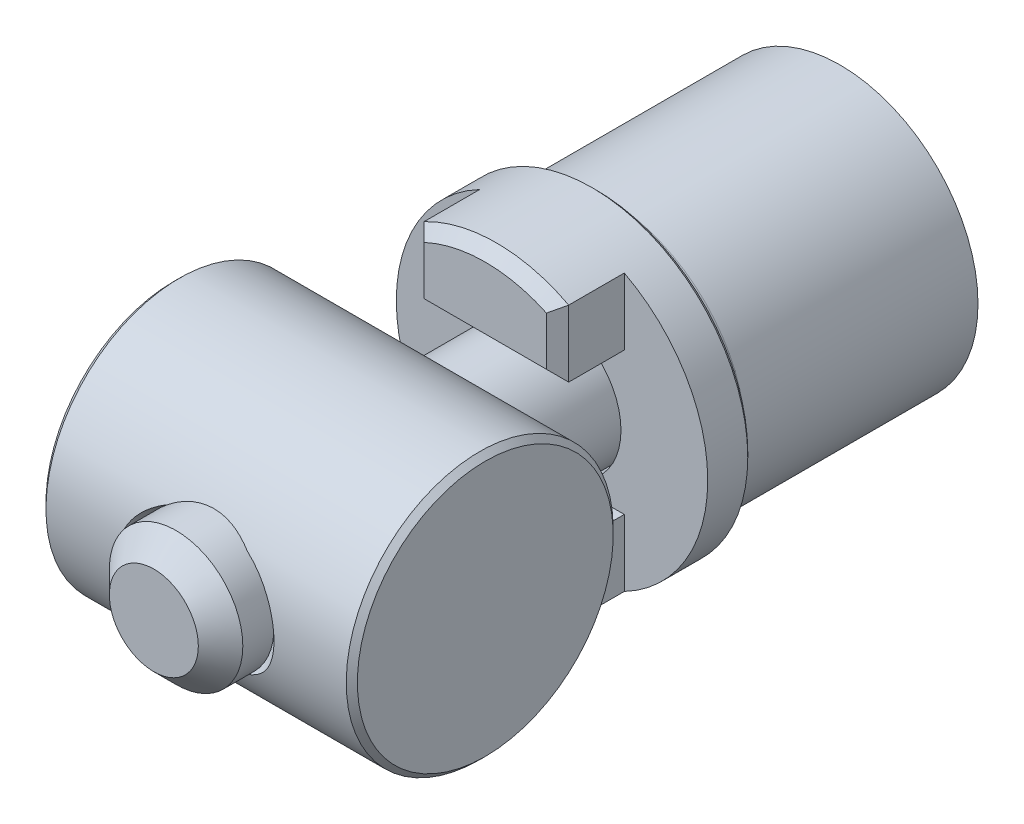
ISO-10303-21;
HEADER;
FILE_DESCRIPTION(('STEP AP214'),'2;1');
FILE_NAME('part.step','',(''),(''),'','','');
FILE_SCHEMA(('AUTOMOTIVE_DESIGN { 1 0 10303 214 1 1 1 1 }'));
ENDSEC;
DATA;
#1=APPLICATION_CONTEXT('core data for automotive mechanical design processes');
#2=APPLICATION_PROTOCOL_DEFINITION('international standard','automotive_design',2000,#1);
#3=PRODUCT_CONTEXT('',#1,'mechanical');
#4=PRODUCT('Part','Part','',(#3));
#5=PRODUCT_RELATED_PRODUCT_CATEGORY('part','',(#4));
#6=PRODUCT_DEFINITION_FORMATION('','',#4);
#7=PRODUCT_DEFINITION_CONTEXT('part definition',#1,'design');
#8=PRODUCT_DEFINITION('design','',#6,#7);
#9=PRODUCT_DEFINITION_SHAPE('','',#8);
#10=(LENGTH_UNIT() NAMED_UNIT(*) SI_UNIT(.MILLI.,.METRE.));
#11=(NAMED_UNIT(*) PLANE_ANGLE_UNIT() SI_UNIT($,.RADIAN.));
#12=(NAMED_UNIT(*) SI_UNIT($,.STERADIAN.) SOLID_ANGLE_UNIT());
#13=UNCERTAINTY_MEASURE_WITH_UNIT(LENGTH_MEASURE(1.E-05),#10,'distance_accuracy_value','');
#14=(GEOMETRIC_REPRESENTATION_CONTEXT(3) GLOBAL_UNCERTAINTY_ASSIGNED_CONTEXT((#13)) GLOBAL_UNIT_ASSIGNED_CONTEXT((#10,
#11,#12)) REPRESENTATION_CONTEXT('',''));
#15=CARTESIAN_POINT('',(0.,0.,0.));
#16=DIRECTION('',(0.,0.,1.));
#17=DIRECTION('',(1.,0.,0.));
#18=AXIS2_PLACEMENT_3D('',#15,#16,#17);
#19=CARTESIAN_POINT('',(0.,0.,10.85));
#20=DIRECTION('',(0.,0.,-1.));
#21=DIRECTION('',(-1.,0.,0.));
#22=AXIS2_PLACEMENT_3D('',#19,#20,#21);
#23=CYLINDRICAL_SURFACE('',#22,3.);
#24=CARTESIAN_POINT('',(0.,0.,17.45));
#25=DIRECTION('',(0.,0.,-1.));
#26=DIRECTION('',(0.,1.,0.));
#27=AXIS2_PLACEMENT_3D('',#24,#25,#26);
#28=CIRCLE('',#27,3.);
#29=CARTESIAN_POINT('',(-1.80277563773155,2.39791576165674,17.45));
#30=VERTEX_POINT('',#29);
#31=CARTESIAN_POINT('',(-1.80277563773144,-2.39791576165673,17.45));
#32=VERTEX_POINT('',#31);
#33=EDGE_CURVE('E167',#30,#32,#28,.F.);
#34=ORIENTED_EDGE('',*,*,#33,.F.);
#35=CARTESIAN_POINT('',(-3.,0.,16.9499999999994));
#36=CARTESIAN_POINT('',(-2.99999916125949,-0.0788941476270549,16.9500006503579));
#37=CARTESIAN_POINT('',(-2.99688205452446,-0.157796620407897,16.951561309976));
#38=CARTESIAN_POINT('',(-2.98446072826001,-0.315001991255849,16.9577564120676));
#39=CARTESIAN_POINT('',(-2.97515372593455,-0.393304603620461,16.962392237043));
#40=CARTESIAN_POINT('',(-2.93804214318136,-0.626628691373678,16.9807802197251));
#41=CARTESIAN_POINT('',(-2.90104717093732,-0.77995289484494,16.9990126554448));
#42=CARTESIAN_POINT('',(-2.80441822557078,-1.07683586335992,17.045510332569));
#43=CARTESIAN_POINT('',(-2.74487223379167,-1.22043005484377,17.0737365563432));
#44=CARTESIAN_POINT('',(-2.60528874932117,-1.49540820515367,17.1376269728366));
#45=CARTESIAN_POINT('',(-2.52525287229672,-1.62679312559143,17.1732905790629));
#46=CARTESIAN_POINT('',(-2.34144601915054,-1.88252701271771,17.2513124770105));
#47=CARTESIAN_POINT('',(-2.23653205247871,-2.0059694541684,17.2939452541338));
#48=CARTESIAN_POINT('',(-2.00844407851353,-2.23433451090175,17.3801996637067));
#49=CARTESIAN_POINT('',(-1.88525628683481,-2.33924301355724,17.4238220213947));
#50=CARTESIAN_POINT('',(-1.61251563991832,-2.53576864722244,17.511036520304));
#51=CARTESIAN_POINT('',(-1.46165902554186,-2.62572411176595,17.5543639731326));
#52=CARTESIAN_POINT('',(-1.22404914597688,-2.74034031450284,17.6121755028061));
#53=CARTESIAN_POINT('',(-1.14292907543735,-2.77516786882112,17.6302542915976));
#54=CARTESIAN_POINT('',(-0.977399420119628,-2.8376929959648,17.6633423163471));
#55=CARTESIAN_POINT('',(-0.892991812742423,-2.86539478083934,17.6783533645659));
#56=CARTESIAN_POINT('',(-0.726604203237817,-2.91188280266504,17.703896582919));
#57=CARTESIAN_POINT('',(-0.644777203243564,-2.93110042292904,17.7146416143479));
#58=CARTESIAN_POINT('',(-0.479445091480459,-2.96263559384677,17.7324221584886));
#59=CARTESIAN_POINT('',(-0.395940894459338,-2.97495680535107,17.7394596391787));
#60=CARTESIAN_POINT('',(-0.227993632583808,-2.99251382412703,17.7495224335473));
#61=CARTESIAN_POINT('',(-0.143551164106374,-2.99775389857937,17.752550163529));
#62=CARTESIAN_POINT('',(0.0254936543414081,-3.00108452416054,17.7544744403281));
#63=CARTESIAN_POINT('',(0.110095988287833,-2.99917575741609,17.7533713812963));
#64=CARTESIAN_POINT('',(0.342753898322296,-2.98404973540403,17.7446533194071));
#65=CARTESIAN_POINT('',(0.490244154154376,-2.96335042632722,17.7327320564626));
#66=CARTESIAN_POINT('',(0.779193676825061,-2.90082280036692,17.6977181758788));
#67=CARTESIAN_POINT('',(0.920651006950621,-2.85898775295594,17.674621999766));
#68=CARTESIAN_POINT('',(1.19767965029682,-2.75462843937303,17.6193743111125));
#69=CARTESIAN_POINT('',(1.33303711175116,-2.69164495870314,17.58702440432));
#70=CARTESIAN_POINT('',(1.59190496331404,-2.54712530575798,17.5168982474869));
#71=CARTESIAN_POINT('',(1.71540999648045,-2.46558080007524,17.4791195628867));
#72=CARTESIAN_POINT('',(1.96356309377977,-2.27419808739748,17.3966051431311));
#73=CARTESIAN_POINT('',(2.0863704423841,-2.16208335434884,17.3515946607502));
#74=CARTESIAN_POINT('',(2.31220643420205,-1.91866675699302,17.2635713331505));
#75=CARTESIAN_POINT('',(2.41522562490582,-1.78735577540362,17.220559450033));
#76=CARTESIAN_POINT('',(2.60305693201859,-1.50154951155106,17.1389403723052));
#77=CARTESIAN_POINT('',(2.68680140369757,-1.34626077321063,17.1006304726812));
#78=CARTESIAN_POINT('',(2.8262911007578,-1.02139864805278,17.0352635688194));
#79=CARTESIAN_POINT('',(2.88205855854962,-0.851836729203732,17.0081976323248));
#80=CARTESIAN_POINT('',(2.95942620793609,-0.518299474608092,16.9702699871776));
#81=CARTESIAN_POINT('',(2.98347370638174,-0.355024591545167,16.9582518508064));
#82=CARTESIAN_POINT('',(3.00439419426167,-0.0263387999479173,16.9478095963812));
#83=CARTESIAN_POINT('',(3.00128005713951,0.139071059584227,16.9493790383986));
#84=CARTESIAN_POINT('',(2.9693799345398,0.453698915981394,16.9652642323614));
#85=CARTESIAN_POINT('',(2.94260240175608,0.603178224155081,16.9785826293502));
#86=CARTESIAN_POINT('',(2.86728578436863,0.895220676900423,17.0153348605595));
#87=CARTESIAN_POINT('',(2.81874430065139,1.03778305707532,17.0387698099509));
#88=CARTESIAN_POINT('',(2.70000460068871,1.31666582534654,17.0944724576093));
#89=CARTESIAN_POINT('',(2.62922684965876,1.45269119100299,17.1269735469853));
#90=CARTESIAN_POINT('',(2.46867739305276,1.71138408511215,17.1976807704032));
#91=CARTESIAN_POINT('',(2.37889759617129,1.83404588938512,17.2358893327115));
#92=CARTESIAN_POINT('',(2.1727187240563,2.07530306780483,17.3187533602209));
#93=CARTESIAN_POINT('',(2.05457139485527,2.19231623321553,17.3636734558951));
#94=CARTESIAN_POINT('',(1.80022454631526,2.40556896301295,17.4521282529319));
#95=CARTESIAN_POINT('',(1.66401264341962,2.50179415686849,17.495661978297));
#96=CARTESIAN_POINT('',(1.3690690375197,2.67512374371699,17.578464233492));
#97=CARTESIAN_POINT('',(1.2095662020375,2.7510764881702,17.6174241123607));
#98=CARTESIAN_POINT('',(0.877469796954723,2.87424847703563,17.6827778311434));
#99=CARTESIAN_POINT('',(0.704893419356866,2.92150474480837,17.709187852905));
#100=CARTESIAN_POINT('',(0.369269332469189,2.98158506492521,17.7431549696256));
#101=CARTESIAN_POINT('',(0.206897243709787,2.99727899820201,17.7522784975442));
#102=CARTESIAN_POINT('',(-0.118341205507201,3.00206745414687,17.7550393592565));
#103=CARTESIAN_POINT('',(-0.28120732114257,2.99117350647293,17.7486834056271));
#104=CARTESIAN_POINT('',(-0.586450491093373,2.94577840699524,17.7228641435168));
#105=CARTESIAN_POINT('',(-0.729301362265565,2.91362505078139,17.7047071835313));
#106=CARTESIAN_POINT('',(-1.00742440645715,2.82952596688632,17.6588694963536));
#107=CARTESIAN_POINT('',(-1.14269412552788,2.7775738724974,17.6311857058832));
#108=CARTESIAN_POINT('',(-1.41187436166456,2.65144766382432,17.5671441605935));
#109=CARTESIAN_POINT('',(-1.54508296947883,2.57601505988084,17.5303286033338));
#110=CARTESIAN_POINT('',(-1.79782434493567,2.40645126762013,17.4529397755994));
#111=CARTESIAN_POINT('',(-1.91734994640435,2.31231035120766,17.4123645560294));
#112=CARTESIAN_POINT('',(-2.15442285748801,2.09461689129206,17.3261314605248));
#113=CARTESIAN_POINT('',(-2.26996512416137,1.96888052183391,17.2804550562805));
#114=CARTESIAN_POINT('',(-2.47880114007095,1.69843715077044,17.1936628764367));
#115=CARTESIAN_POINT('',(-2.57208289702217,1.55371998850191,17.1525495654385));
#116=CARTESIAN_POINT('',(-2.69317818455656,1.32452333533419,17.09748593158));
#117=CARTESIAN_POINT('',(-2.73052020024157,1.24575314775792,17.0801747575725));
#118=CARTESIAN_POINT('',(-2.79836167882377,1.08479725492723,17.0483115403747));
#119=CARTESIAN_POINT('',(-2.82886449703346,1.00261324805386,17.0337581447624));
#120=CARTESIAN_POINT('',(-2.8826072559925,0.835616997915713,17.0078730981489));
#121=CARTESIAN_POINT('',(-2.90586304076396,0.750810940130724,16.9965344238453));
#122=CARTESIAN_POINT('',(-2.94488257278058,0.579142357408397,16.9773922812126));
#123=CARTESIAN_POINT('',(-2.96065089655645,0.492281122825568,16.9695866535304));
#124=CARTESIAN_POINT('',(-2.98168467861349,0.337824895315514,16.9591417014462));
#125=CARTESIAN_POINT('',(-2.98854691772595,0.270495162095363,16.955719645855));
#126=CARTESIAN_POINT('',(-2.99770500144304,0.135445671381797,16.9511484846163));
#127=CARTESIAN_POINT('',(-3.00000072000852,0.0677259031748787,16.9499994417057));
#128=CARTESIAN_POINT('',(-3.,0.,16.9499999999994));
#129=B_SPLINE_CURVE_WITH_KNOTS('',3,(#35,#36,#37,#38,#39,#40,#41,#42,#43,#44,#45,#46,#47,#48,
#49,#50,#51,#52,#53,#54,#55,#56,#57,#58,#59,#60,#61,#62,#63,#64,#65,#66,#67,#68,#69,#70,#71,#72,
#73,#74,#75,#76,#77,#78,#79,#80,#81,#82,#83,#84,#85,#86,#87,#88,#89,#90,#91,#92,#93,#94,#95,#96,
#97,#98,#99,#100,#101,#102,#103,#104,#105,#106,#107,#108,#109,#110,#111,#112,#113,#114,#115,
#116,#117,#118,#119,#120,#121,#122,#123,#124,#125,#126,#127,#128),.UNSPECIFIED.,.T.,.F.,(4,2,2,
2,2,2,2,2,2,2,2,2,2,2,2,2,2,2,2,2,2,2,2,2,2,2,2,2,2,2,2,2,2,2,2,2,2,2,2,2,2,2,2,2,2,2,4),(0.,
0.236611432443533,0.473329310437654,0.947100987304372,1.41904300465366,1.89094781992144,
2.39140181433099,2.89223525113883,3.43190833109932,3.70192714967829,3.97178599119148,
4.22563720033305,4.47935352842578,4.73291689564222,4.98645606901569,5.43238672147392,
5.8784594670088,6.33492255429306,6.79159098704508,7.30616358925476,7.82098138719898,
8.3597060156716,8.89800185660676,9.39171406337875,9.88519228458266,10.340422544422,
10.7957029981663,11.2640010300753,11.7324988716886,12.2470036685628,12.7618630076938,
13.3016558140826,13.8407507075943,14.3280945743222,14.8152271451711,15.2559532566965,
15.6968212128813,16.1673090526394,16.6380421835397,17.1659726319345,17.6941868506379,
17.9605054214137,18.2266930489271,18.4922945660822,18.7577335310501,18.9608446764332,
19.1639614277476),.UNSPECIFIED.);
#130=CARTESIAN_POINT('',(1.80277563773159,2.39791576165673,17.45));
#131=VERTEX_POINT('',#130);
#132=EDGE_CURVE('E170',#131,#30,#129,.T.);
#133=ORIENTED_EDGE('',*,*,#132,.F.);
#134=CARTESIAN_POINT('',(1.80277563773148,-2.39791576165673,17.45));
#135=VERTEX_POINT('',#134);
#136=EDGE_CURVE('E177',#135,#131,#28,.F.);
#137=ORIENTED_EDGE('',*,*,#136,.F.);
#138=EDGE_CURVE('E173',#32,#135,#129,.T.);
#139=ORIENTED_EDGE('',*,*,#138,.F.);
#140=EDGE_LOOP('',(#34,#133,#137,#139));
#141=FACE_BOUND('',#140,.T.);
#142=CARTESIAN_POINT('',(0.,0.,10.95));
#143=DIRECTION('',(0.,0.,-1.));
#144=DIRECTION('',(1.,0.,0.));
#145=AXIS2_PLACEMENT_3D('',#142,#143,#144);
#146=CIRCLE('',#145,3.);
#147=CARTESIAN_POINT('',(3.00000000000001,0.,10.95));
#148=VERTEX_POINT('',#147);
#149=EDGE_CURVE('E18',#148,#148,#146,.F.);
#150=ORIENTED_EDGE('',*,*,#149,.T.);
#151=EDGE_LOOP('',(#150));
#152=FACE_BOUND('',#151,.T.);
#153=ADVANCED_FACE('F14',(#141,#152),#23,.T.);
#154=CARTESIAN_POINT('',(-6.30000000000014,0.,22.95));
#155=DIRECTION('',(-1.00000000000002,0.,0.));
#156=DIRECTION('',(0.,1.00000000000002,0.));
#157=AXIS2_PLACEMENT_3D('',#154,#155,#156);
#158=CONICAL_SURFACE('',#157,1.65,0.785398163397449);
#159=CARTESIAN_POINT('',(-7.00000000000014,0.,22.95));
#160=DIRECTION('',(1.00000000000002,0.,0.));
#161=DIRECTION('',(0.,-1.00000000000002,0.));
#162=AXIS2_PLACEMENT_3D('',#159,#160,#161);
#163=CIRCLE('',#162,2.35);
#164=CARTESIAN_POINT('',(-7.00000000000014,-2.35000000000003,22.95));
#165=VERTEX_POINT('',#164);
#166=EDGE_CURVE('E432',#165,#165,#163,.T.);
#167=ORIENTED_EDGE('',*,*,#166,.F.);
#168=EDGE_LOOP('',(#167));
#169=FACE_BOUND('',#168,.T.);
#170=CARTESIAN_POINT('',(-6.5,0.,22.95));
#171=DIRECTION('',(1.,0.,0.));
#172=DIRECTION('',(0.,0.,1.));
#173=AXIS2_PLACEMENT_3D('',#170,#171,#172);
#174=CIRCLE('',#173,1.84999999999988);
#175=CARTESIAN_POINT('',(-6.5,0.,24.7999999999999));
#176=VERTEX_POINT('',#175);
#177=EDGE_CURVE('E436',#176,#176,#174,.T.);
#178=ORIENTED_EDGE('',*,*,#177,.T.);
#179=EDGE_LOOP('',(#178));
#180=FACE_BOUND('',#179,.T.);
#181=ADVANCED_FACE('F218',(#169,#180),#158,.F.);
#182=CARTESIAN_POINT('',(-3.,0.,30.85));
#183=DIRECTION('',(0.,0.,1.));
#184=DIRECTION('',(1.,0.,0.));
#185=AXIS2_PLACEMENT_3D('',#182,#183,#184);
#186=PLANE('',#185);
#187=CARTESIAN_POINT('',(0.,0.,30.85));
#188=DIRECTION('',(0.,0.,1.));
#189=DIRECTION('',(1.,0.,0.));
#190=AXIS2_PLACEMENT_3D('',#187,#188,#189);
#191=CIRCLE('',#190,2.);
#192=CARTESIAN_POINT('',(2.00000000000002,0.,30.85));
#193=VERTEX_POINT('',#192);
#194=EDGE_CURVE('E435',#193,#193,#191,.T.);
#195=ORIENTED_EDGE('',*,*,#194,.T.);
#196=EDGE_LOOP('',(#195));
#197=FACE_BOUND('',#196,.T.);
#198=ADVANCED_FACE('F221',(#197),#186,.T.);
#199=CARTESIAN_POINT('',(0.,0.,29.85));
#200=DIRECTION('',(0.,0.,-1.));
#201=DIRECTION('',(-1.,0.,0.));
#202=AXIS2_PLACEMENT_3D('',#199,#200,#201);
#203=CONICAL_SURFACE('',#202,3.,0.785398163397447);
#204=ORIENTED_EDGE('',*,*,#194,.F.);
#205=EDGE_LOOP('',(#204));
#206=FACE_BOUND('',#205,.T.);
#207=CARTESIAN_POINT('',(0.,0.,29.85));
#208=DIRECTION('',(0.,0.,1.));
#209=DIRECTION('',(1.,0.,0.));
#210=AXIS2_PLACEMENT_3D('',#207,#208,#209);
#211=CIRCLE('',#210,3.);
#212=CARTESIAN_POINT('',(3.00000000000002,0.,29.85));
#213=VERTEX_POINT('',#212);
#214=EDGE_CURVE('E199',#213,#213,#211,.F.);
#215=ORIENTED_EDGE('',*,*,#214,.F.);
#216=EDGE_LOOP('',(#215));
#217=FACE_BOUND('',#216,.T.);
#218=ADVANCED_FACE('F393',(#206,#217),#203,.T.);
#219=ORIENTED_EDGE('',*,*,#214,.T.);
#220=EDGE_LOOP('',(#219));
#221=FACE_BOUND('',#220,.T.);
#222=CARTESIAN_POINT('',(0.,0.,28.45));
#223=DIRECTION('',(0.,0.,1.));
#224=DIRECTION('',(0.,-1.,0.));
#225=AXIS2_PLACEMENT_3D('',#222,#223,#224);
#226=CIRCLE('',#225,3.);
#227=CARTESIAN_POINT('',(-1.80277563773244,-2.39791576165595,28.45));
#228=VERTEX_POINT('',#227);
#229=CARTESIAN_POINT('',(-1.80277563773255,2.39791576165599,28.45));
#230=VERTEX_POINT('',#229);
#231=EDGE_CURVE('E407',#228,#230,#226,.F.);
#232=ORIENTED_EDGE('',*,*,#231,.F.);
#233=CARTESIAN_POINT('',(-3.,0.,28.9499999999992));
#234=CARTESIAN_POINT('',(-2.99999916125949,0.0788941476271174,28.9499993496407));
#235=CARTESIAN_POINT('',(-2.99688205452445,0.157796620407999,28.9484386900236));
#236=CARTESIAN_POINT('',(-2.98446072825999,0.315001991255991,28.9422435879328));
#237=CARTESIAN_POINT('',(-2.97515372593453,0.393304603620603,28.9376077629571));
#238=CARTESIAN_POINT('',(-2.93804214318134,0.626628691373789,28.9192197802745));
#239=CARTESIAN_POINT('',(-2.90104717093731,0.779952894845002,28.9009873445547));
#240=CARTESIAN_POINT('',(-2.80441822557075,1.07683586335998,28.8544896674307));
#241=CARTESIAN_POINT('',(-2.74487223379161,1.22043005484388,28.8262634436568));
#242=CARTESIAN_POINT('',(-2.60528874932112,1.49540820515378,28.7623730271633));
#243=CARTESIAN_POINT('',(-2.52525287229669,1.6267931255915,28.7267094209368));
#244=CARTESIAN_POINT('',(-2.34144601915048,1.88252701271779,28.6486875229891));
#245=CARTESIAN_POINT('',(-2.23653205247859,2.00596945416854,28.6060547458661));
#246=CARTESIAN_POINT('',(-2.00844407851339,2.23433451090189,28.5198003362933));
#247=CARTESIAN_POINT('',(-1.88525628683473,2.33924301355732,28.476177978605));
#248=CARTESIAN_POINT('',(-1.61251563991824,2.53576864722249,28.3889634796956));
#249=CARTESIAN_POINT('',(-1.46165902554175,2.62572411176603,28.3456360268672));
#250=CARTESIAN_POINT('',(-1.22404914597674,2.74034031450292,28.287824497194));
#251=CARTESIAN_POINT('',(-1.1429290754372,2.77516786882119,28.2697457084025));
#252=CARTESIAN_POINT('',(-0.977399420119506,2.83769299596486,28.2366576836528));
#253=CARTESIAN_POINT('',(-0.892991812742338,2.86539478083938,28.2216466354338));
#254=CARTESIAN_POINT('',(-0.726604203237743,2.91188280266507,28.1961034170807));
#255=CARTESIAN_POINT('',(-0.644777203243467,2.93110042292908,28.185358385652));
#256=CARTESIAN_POINT('',(-0.479445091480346,2.96263559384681,28.1675778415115));
#257=CARTESIAN_POINT('',(-0.395940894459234,2.9749568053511,28.1605403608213));
#258=CARTESIAN_POINT('',(-0.227993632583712,2.99251382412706,28.1504775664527));
#259=CARTESIAN_POINT('',(-0.143551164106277,2.99775389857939,28.1474498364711));
#260=CARTESIAN_POINT('',(0.0254936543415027,3.00108452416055,28.1455255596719));
#261=CARTESIAN_POINT('',(0.110095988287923,2.99917575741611,28.1466286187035));
#262=CARTESIAN_POINT('',(0.342753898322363,2.98404973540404,28.1553466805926));
#263=CARTESIAN_POINT('',(0.49024415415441,2.96335042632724,28.1672679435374));
#264=CARTESIAN_POINT('',(0.7791936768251,2.90082280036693,28.2022818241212));
#265=CARTESIAN_POINT('',(0.920651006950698,2.85898775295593,28.2253780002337));
#266=CARTESIAN_POINT('',(1.19767965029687,2.75462843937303,28.2806256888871));
#267=CARTESIAN_POINT('',(1.33303711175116,2.69164495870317,28.31297559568));
#268=CARTESIAN_POINT('',(1.59190496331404,2.54712530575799,28.3831017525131));
#269=CARTESIAN_POINT('',(1.71540999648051,2.46558080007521,28.4208804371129));
#270=CARTESIAN_POINT('',(1.96356309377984,2.27419808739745,28.5033948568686));
#271=CARTESIAN_POINT('',(2.08637044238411,2.16208335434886,28.5484053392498));
#272=CARTESIAN_POINT('',(2.31220643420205,1.91866675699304,28.6364286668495));
#273=CARTESIAN_POINT('',(2.41522562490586,1.78735577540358,28.6794405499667));
#274=CARTESIAN_POINT('',(2.60305693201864,1.50154951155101,28.7610596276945));
#275=CARTESIAN_POINT('',(2.6868014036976,1.34626077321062,28.7993695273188));
#276=CARTESIAN_POINT('',(2.82629110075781,1.02139864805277,28.8647364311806));
#277=CARTESIAN_POINT('',(2.88205855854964,0.851836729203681,28.891802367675));
#278=CARTESIAN_POINT('',(2.95942620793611,0.518299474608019,28.9297300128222));
#279=CARTESIAN_POINT('',(2.98347370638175,0.355024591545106,28.9417481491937));
#280=CARTESIAN_POINT('',(3.00439419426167,0.0263387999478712,28.9521904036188));
#281=CARTESIAN_POINT('',(3.00128005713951,-0.139071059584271,28.9506209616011));
#282=CARTESIAN_POINT('',(2.96937993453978,-0.453698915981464,28.9347357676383));
#283=CARTESIAN_POINT('',(2.94260240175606,-0.603178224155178,28.9214173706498));
#284=CARTESIAN_POINT('',(2.86728578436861,-0.895220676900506,28.8846651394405));
#285=CARTESIAN_POINT('',(2.81874430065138,-1.03778305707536,28.8612301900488));
#286=CARTESIAN_POINT('',(2.70000460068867,-1.31666582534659,28.8055275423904));
#287=CARTESIAN_POINT('',(2.62922684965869,-1.45269119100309,28.7730264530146));
#288=CARTESIAN_POINT('',(2.46867739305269,-1.71138408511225,28.7023192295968));
#289=CARTESIAN_POINT('',(2.37889759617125,-1.83404588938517,28.6641106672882));
#290=CARTESIAN_POINT('',(2.17271872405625,-2.07530306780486,28.5812466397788));
#291=CARTESIAN_POINT('',(2.05457139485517,-2.1923162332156,28.5363265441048));
#292=CARTESIAN_POINT('',(1.80022454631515,-2.40556896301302,28.447871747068));
#293=CARTESIAN_POINT('',(1.66401264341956,-2.50179415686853,28.4043380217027));
#294=CARTESIAN_POINT('',(1.36906903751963,-2.67512374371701,28.3215357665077));
#295=CARTESIAN_POINT('',(1.20956620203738,-2.75107648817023,28.2825758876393));
#296=CARTESIAN_POINT('',(0.877469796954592,-2.87424847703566,28.2172221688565));
#297=CARTESIAN_POINT('',(0.704893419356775,-2.92150474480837,28.1908121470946));
#298=CARTESIAN_POINT('',(0.369269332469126,-2.9815850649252,28.156845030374));
#299=CARTESIAN_POINT('',(0.206897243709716,-2.99727899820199,28.1477215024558));
#300=CARTESIAN_POINT('',(-0.118341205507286,-3.00206745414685,28.1449606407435));
#301=CARTESIAN_POINT('',(-0.281207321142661,-2.99117350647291,28.1513165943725));
#302=CARTESIAN_POINT('',(-0.586450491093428,-2.94577840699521,28.1771358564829));
#303=CARTESIAN_POINT('',(-0.729301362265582,-2.91362505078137,28.1952928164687));
#304=CARTESIAN_POINT('',(-1.00742440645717,-2.82952596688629,28.2411305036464));
#305=CARTESIAN_POINT('',(-1.14269412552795,-2.77757387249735,28.2688142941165));
#306=CARTESIAN_POINT('',(-1.41187436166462,-2.65144766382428,28.3328558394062));
#307=CARTESIAN_POINT('',(-1.54508296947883,-2.57601505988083,28.3696713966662));
#308=CARTESIAN_POINT('',(-1.79782434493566,-2.4064512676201,28.4470602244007));
#309=CARTESIAN_POINT('',(-1.9173499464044,-2.31231035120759,28.4876354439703));
#310=CARTESIAN_POINT('',(-2.15442285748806,-2.094616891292,28.5738685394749));
#311=CARTESIAN_POINT('',(-2.26996512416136,-1.96888052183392,28.6195449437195));
#312=CARTESIAN_POINT('',(-2.47880114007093,-1.69843715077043,28.7063371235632));
#313=CARTESIAN_POINT('',(-2.5720828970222,-1.5537199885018,28.747450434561));
#314=CARTESIAN_POINT('',(-2.69317818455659,-1.3245233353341,28.8025140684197));
#315=CARTESIAN_POINT('',(-2.73052020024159,-1.24575314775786,28.8198252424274));
#316=CARTESIAN_POINT('',(-2.79836167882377,-1.08479725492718,28.8516884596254));
#317=CARTESIAN_POINT('',(-2.82886449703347,-1.00261324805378,28.8662418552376));
#318=CARTESIAN_POINT('',(-2.88260725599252,-0.835616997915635,28.8921269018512));
#319=CARTESIAN_POINT('',(-2.90586304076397,-0.750810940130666,28.9034655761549));
#320=CARTESIAN_POINT('',(-2.94488257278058,-0.579142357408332,28.9226077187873));
#321=CARTESIAN_POINT('',(-2.96065089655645,-0.492281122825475,28.9304133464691));
#322=CARTESIAN_POINT('',(-2.98168467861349,-0.337824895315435,28.9408582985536));
#323=CARTESIAN_POINT('',(-2.98854691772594,-0.270495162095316,28.9442803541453));
#324=CARTESIAN_POINT('',(-2.99770500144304,-0.135445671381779,28.9488515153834));
#325=CARTESIAN_POINT('',(-3.00000072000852,-0.0677259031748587,28.9500005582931));
#326=CARTESIAN_POINT('',(-3.,0.,28.9499999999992));
#327=B_SPLINE_CURVE_WITH_KNOTS('',3,(#233,#234,#235,#236,#237,#238,#239,#240,#241,#242,#243,
#244,#245,#246,#247,#248,#249,#250,#251,#252,#253,#254,#255,#256,#257,#258,#259,#260,#261,#262,
#263,#264,#265,#266,#267,#268,#269,#270,#271,#272,#273,#274,#275,#276,#277,#278,#279,#280,#281,
#282,#283,#284,#285,#286,#287,#288,#289,#290,#291,#292,#293,#294,#295,#296,#297,#298,#299,#300,
#301,#302,#303,#304,#305,#306,#307,#308,#309,#310,#311,#312,#313,#314,#315,#316,#317,#318,#319,
#320,#321,#322,#323,#324,#325,#326),.UNSPECIFIED.,.T.,.F.,(4,2,2,2,2,2,2,2,2,2,2,2,2,2,2,2,2,2,
2,2,2,2,2,2,2,2,2,2,2,2,2,2,2,2,2,2,2,2,2,2,2,2,2,2,2,2,4),(0.,0.236611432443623,
0.473329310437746,0.947100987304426,1.41904300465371,1.89094781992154,2.39140181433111,
2.89223525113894,3.43190833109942,3.70192714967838,3.97178599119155,4.22563720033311,
4.47935352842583,4.73291689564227,4.98645606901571,5.43238672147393,5.8784594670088,
6.33492255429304,6.79159098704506,7.30616358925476,7.82098138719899,8.35970601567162,
8.8980018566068,9.39171406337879,9.88519228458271,10.3404225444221,10.7957029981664,
11.2640010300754,11.7324988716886,12.2470036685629,12.7618630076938,13.3016558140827,
13.8407507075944,14.3280945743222,14.8152271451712,15.2559532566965,15.6968212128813,
16.1673090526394,16.6380421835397,17.1659726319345,17.6941868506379,17.9605054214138,
18.2266930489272,18.4922945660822,18.7577335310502,18.9608446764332,19.1639614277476),.UNSPECIFIED.);
#328=CARTESIAN_POINT('',(1.80277563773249,-2.39791576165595,28.45));
#329=VERTEX_POINT('',#328);
#330=EDGE_CURVE('E409',#329,#228,#327,.T.);
#331=ORIENTED_EDGE('',*,*,#330,.F.);
#332=CARTESIAN_POINT('',(1.80277563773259,2.39791576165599,28.45));
#333=VERTEX_POINT('',#332);
#334=EDGE_CURVE('E192',#333,#329,#226,.F.);
#335=ORIENTED_EDGE('',*,*,#334,.F.);
#336=EDGE_CURVE('E411',#230,#333,#327,.T.);
#337=ORIENTED_EDGE('',*,*,#336,.F.);
#338=EDGE_LOOP('',(#232,#331,#335,#337));
#339=FACE_BOUND('',#338,.T.);
#340=ADVANCED_FACE('F229',(#221,#339),#23,.T.);
#341=CARTESIAN_POINT('',(7.00000000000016,0.,22.95));
#342=DIRECTION('',(1.00000000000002,0.,0.));
#343=DIRECTION('',(0.,-1.00000000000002,0.));
#344=AXIS2_PLACEMENT_3D('',#341,#342,#343);
#345=PLANE('',#344);
#346=CARTESIAN_POINT('',(7.00000000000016,0.,22.95));
#347=DIRECTION('',(1.00000000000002,0.,0.));
#348=DIRECTION('',(0.,-1.00000000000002,0.));
#349=AXIS2_PLACEMENT_3D('',#346,#347,#348);
#350=CIRCLE('',#349,5.75);
#351=CARTESIAN_POINT('',(7.00000000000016,-5.7500000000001,22.95));
#352=VERTEX_POINT('',#351);
#353=EDGE_CURVE('E419',#352,#352,#350,.T.);
#354=ORIENTED_EDGE('',*,*,#353,.T.);
#355=EDGE_LOOP('',(#354));
#356=FACE_BOUND('',#355,.T.);
#357=ADVANCED_FACE('F223',(#356),#345,.T.);
#358=CARTESIAN_POINT('',(-7.00000000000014,0.,22.95));
#359=DIRECTION('',(1.00000000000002,0.,0.));
#360=DIRECTION('',(0.,-1.00000000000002,0.));
#361=AXIS2_PLACEMENT_3D('',#358,#359,#360);
#362=PLANE('',#361);
#363=ORIENTED_EDGE('',*,*,#166,.T.);
#364=EDGE_LOOP('',(#363));
#365=FACE_BOUND('',#364,.T.);
#366=CARTESIAN_POINT('',(-7.00000000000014,0.,22.95));
#367=DIRECTION('',(1.00000000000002,0.,0.));
#368=DIRECTION('',(0.,-1.00000000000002,0.));
#369=AXIS2_PLACEMENT_3D('',#366,#367,#368);
#370=CIRCLE('',#369,5.75);
#371=CARTESIAN_POINT('',(-7.00000000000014,-5.7500000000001,22.95));
#372=VERTEX_POINT('',#371);
#373=EDGE_CURVE('E421',#372,#372,#370,.F.);
#374=ORIENTED_EDGE('',*,*,#373,.T.);
#375=EDGE_LOOP('',(#374));
#376=FACE_BOUND('',#375,.T.);
#377=ADVANCED_FACE('F399',(#365,#376),#362,.F.);
#378=CARTESIAN_POINT('',(7.00000000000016,0.,22.95));
#379=DIRECTION('',(-1.00000000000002,0.,0.));
#380=DIRECTION('',(0.,1.00000000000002,0.));
#381=AXIS2_PLACEMENT_3D('',#378,#379,#380);
#382=CONICAL_SURFACE('',#381,5.75,0.785398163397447);
#383=CARTESIAN_POINT('',(6.75000000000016,0.,22.95));
#384=DIRECTION('',(1.00000000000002,0.,0.));
#385=DIRECTION('',(0.,-1.00000000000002,0.));
#386=AXIS2_PLACEMENT_3D('',#383,#384,#385);
#387=CIRCLE('',#386,6.);
#388=CARTESIAN_POINT('',(6.75000000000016,-6.00000000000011,22.95));
#389=VERTEX_POINT('',#388);
#390=EDGE_CURVE('E429',#389,#389,#387,.F.);
#391=ORIENTED_EDGE('',*,*,#390,.F.);
#392=EDGE_LOOP('',(#391));
#393=FACE_BOUND('',#392,.T.);
#394=ORIENTED_EDGE('',*,*,#353,.F.);
#395=EDGE_LOOP('',(#394));
#396=FACE_BOUND('',#395,.T.);
#397=ADVANCED_FACE('F876',(#393,#396),#382,.T.);
#398=CARTESIAN_POINT('',(-6.75000000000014,0.,22.95));
#399=DIRECTION('',(1.00000000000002,0.,0.));
#400=DIRECTION('',(0.,-1.00000000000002,0.));
#401=AXIS2_PLACEMENT_3D('',#398,#399,#400);
#402=CONICAL_SURFACE('',#401,6.,0.785398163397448);
#403=ORIENTED_EDGE('',*,*,#373,.F.);
#404=EDGE_LOOP('',(#403));
#405=FACE_BOUND('',#404,.T.);
#406=CARTESIAN_POINT('',(-6.75000000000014,0.,22.95));
#407=DIRECTION('',(1.00000000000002,0.,0.));
#408=DIRECTION('',(0.,-1.00000000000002,0.));
#409=AXIS2_PLACEMENT_3D('',#406,#407,#408);
#410=CIRCLE('',#409,6.);
#411=CARTESIAN_POINT('',(-6.75000000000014,-6.00000000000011,22.95));
#412=VERTEX_POINT('',#411);
#413=EDGE_CURVE('E424',#412,#412,#410,.T.);
#414=ORIENTED_EDGE('',*,*,#413,.F.);
#415=EDGE_LOOP('',(#414));
#416=FACE_BOUND('',#415,.T.);
#417=ADVANCED_FACE('F868',(#405,#416),#402,.T.);
#418=CARTESIAN_POINT('',(7.00000000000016,0.,22.95));
#419=DIRECTION('',(-1.00000000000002,0.,0.));
#420=DIRECTION('',(0.,1.00000000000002,0.));
#421=AXIS2_PLACEMENT_3D('',#418,#419,#420);
#422=CYLINDRICAL_SURFACE('',#421,6.);
#423=CARTESIAN_POINT('',(-2.28742348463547,-2.11452695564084,17.3349509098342));
#424=CARTESIAN_POINT('',(-2.11715384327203,-2.23299654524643,17.3795602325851));
#425=CARTESIAN_POINT('',(-1.93588592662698,-2.33638090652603,17.4227390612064));
#426=CARTESIAN_POINT('',(-1.55741095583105,-2.51292711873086,17.5007308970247));
#427=CARTESIAN_POINT('',(-1.36018364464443,-2.58604981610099,17.5355330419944));
#428=CARTESIAN_POINT('',(-0.953595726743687,-2.70195270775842,17.5924184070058));
#429=CARTESIAN_POINT('',(-0.744156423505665,-2.74450535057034,17.6144060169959));
#430=CARTESIAN_POINT('',(-0.32036209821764,-2.79768716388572,17.6420935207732));
#431=CARTESIAN_POINT('',(-0.106011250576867,-2.80834249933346,17.6478067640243));
#432=CARTESIAN_POINT('',(0.322542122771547,-2.79756008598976,17.6421104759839));
#433=CARTESIAN_POINT('',(0.536740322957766,-2.77598866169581,17.6306296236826));
#434=CARTESIAN_POINT('',(0.958181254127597,-2.70090476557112,17.5921217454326));
#435=CARTESIAN_POINT('',(1.1654177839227,-2.64736457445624,17.5650812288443));
#436=CARTESIAN_POINT('',(1.56796136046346,-2.5087273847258,17.4991116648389));
#437=CARTESIAN_POINT('',(1.76321783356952,-2.42350607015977,17.4601358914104));
#438=CARTESIAN_POINT('',(2.1353001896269,-2.22178171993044,17.3754481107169));
#439=CARTESIAN_POINT('',(2.31213876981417,-2.10530043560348,17.3297407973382));
#440=CARTESIAN_POINT('',(2.60180557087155,-1.87209414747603,17.2485355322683));
#441=CARTESIAN_POINT('',(2.71990830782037,-1.76186487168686,17.2131637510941));
#442=CARTESIAN_POINT('',(2.93700183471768,-1.52321401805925,17.1452481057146));
#443=CARTESIAN_POINT('',(3.03602386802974,-1.39482278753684,17.1126996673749));
#444=CARTESIAN_POINT('',(3.19213915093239,-1.14858183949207,17.0599012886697));
#445=CARTESIAN_POINT('',(3.25365940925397,-1.03379871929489,17.038494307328));
#446=CARTESIAN_POINT('',(3.35788621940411,-0.795032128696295,17.0016836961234));
#447=CARTESIAN_POINT('',(3.40060581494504,-0.671055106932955,16.9862759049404));
#448=CARTESIAN_POINT('',(3.46452454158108,-0.415997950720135,16.963062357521));
#449=CARTESIAN_POINT('',(3.48557784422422,-0.284875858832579,16.9553081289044));
#450=CARTESIAN_POINT('',(3.50384996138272,-0.0207609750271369,16.9485847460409));
#451=CARTESIAN_POINT('',(3.50107867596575,0.112231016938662,16.9496119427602));
#452=CARTESIAN_POINT('',(3.47357635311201,0.360964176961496,16.9597135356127));
#453=CARTESIAN_POINT('',(3.45124582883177,0.477018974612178,16.9679081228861));
#454=CARTESIAN_POINT('',(3.38935230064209,0.703782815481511,16.9903287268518));
#455=CARTESIAN_POINT('',(3.3497865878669,0.814491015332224,17.0045556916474));
#456=CARTESIAN_POINT('',(3.25325140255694,1.03371987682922,17.038625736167));
#457=CARTESIAN_POINT('',(3.19552031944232,1.14186384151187,17.058711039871));
#458=CARTESIAN_POINT('',(3.06610452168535,1.34860203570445,17.102567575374));
#459=CARTESIAN_POINT('',(2.9944095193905,1.44718914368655,17.1263415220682));
#460=CARTESIAN_POINT('',(2.8011552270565,1.68039705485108,17.1883015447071));
#461=CARTESIAN_POINT('',(2.67245465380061,1.80877283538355,17.2278074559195));
#462=CARTESIAN_POINT('',(2.39554489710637,2.04240082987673,17.3069621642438));
#463=CARTESIAN_POINT('',(2.24730202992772,2.14761226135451,17.3466110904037));
#464=CARTESIAN_POINT('',(1.9336687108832,2.3363455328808,17.4226151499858));
#465=CARTESIAN_POINT('',(1.76805094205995,2.41951156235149,17.458910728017));
#466=CARTESIAN_POINT('',(1.42545864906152,2.56192894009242,17.5238895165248));
#467=CARTESIAN_POINT('',(1.24848797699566,2.62118835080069,17.5525752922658));
#468=CARTESIAN_POINT('',(0.964010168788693,2.69536435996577,17.589413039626));
#469=CARTESIAN_POINT('',(0.859002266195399,2.71841873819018,17.6011078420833));
#470=CARTESIAN_POINT('',(0.647186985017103,2.7564588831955,17.6206097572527));
#471=CARTESIAN_POINT('',(0.540380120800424,2.77144691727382,17.6284179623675));
#472=CARTESIAN_POINT('',(0.325698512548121,2.79329025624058,17.6398512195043));
#473=CARTESIAN_POINT('',(0.217823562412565,2.80014395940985,17.6434754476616));
#474=CARTESIAN_POINT('',(0.00180727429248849,2.80567969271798,17.6464000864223));
#475=CARTESIAN_POINT('',(-0.106334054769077,2.80436199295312,17.6457006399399));
#476=CARTESIAN_POINT('',(-0.32124944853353,2.79360419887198,17.6400271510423));
#477=CARTESIAN_POINT('',(-0.428027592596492,2.78422769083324,17.6350865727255));
#478=CARTESIAN_POINT('',(-0.640347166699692,2.75747988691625,17.6211604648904));
#479=CARTESIAN_POINT('',(-0.745888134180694,2.74010569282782,17.6121734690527));
#480=CARTESIAN_POINT('',(-0.95501168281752,2.69742362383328,17.5904775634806));
#481=CARTESIAN_POINT('',(-1.05859350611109,2.67211274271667,17.5777672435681));
#482=CARTESIAN_POINT('',(-1.2630655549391,2.61364053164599,17.5490803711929));
#483=CARTESIAN_POINT('',(-1.36395476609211,2.58047628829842,17.533102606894));
#484=CARTESIAN_POINT('',(-1.6630929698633,2.46872681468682,17.4807890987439));
#485=CARTESIAN_POINT('',(-1.85631222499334,2.3781878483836,17.4402407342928));
#486=CARTESIAN_POINT('',(-2.22309995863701,2.16570919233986,17.3533197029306));
#487=CARTESIAN_POINT('',(-2.39668617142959,2.04379817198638,17.3069523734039));
#488=CARTESIAN_POINT('',(-2.67575876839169,1.80392219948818,17.2265857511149));
#489=CARTESIAN_POINT('',(-2.78727645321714,1.69300952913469,17.1924731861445));
#490=CARTESIAN_POINT('',(-2.99130868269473,1.4540654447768,17.1275475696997));
#491=CARTESIAN_POINT('',(-3.0838543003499,1.32606259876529,17.0967291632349));
#492=CARTESIAN_POINT('',(-3.22940107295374,1.08035724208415,17.0470022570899));
#493=CARTESIAN_POINT('',(-3.28658092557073,0.965374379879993,17.026943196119));
#494=CARTESIAN_POINT('',(-3.3821128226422,0.726933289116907,16.9929854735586));
#495=CARTESIAN_POINT('',(-3.42047770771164,0.603480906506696,16.9790826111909));
#496=CARTESIAN_POINT('',(-3.47589107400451,0.350413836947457,16.9588905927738));
#497=CARTESIAN_POINT('',(-3.4928106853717,0.220766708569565,16.9526474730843));
#498=CARTESIAN_POINT('',(-3.50347650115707,-0.0396013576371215,16.948720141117));
#499=CARTESIAN_POINT('',(-3.49722961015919,-0.170321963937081,16.9510333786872));
#500=CARTESIAN_POINT('',(-3.46384581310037,-0.415700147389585,16.9632783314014));
#501=CARTESIAN_POINT('',(-3.43878623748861,-0.530689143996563,16.9724521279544));
#502=CARTESIAN_POINT('',(-3.37185177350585,-0.754988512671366,16.9966202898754));
#503=CARTESIAN_POINT('',(-3.32997198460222,-0.864297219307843,17.0116163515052));
#504=CARTESIAN_POINT('',(-3.22842965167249,-1.08203071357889,17.047274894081));
#505=CARTESIAN_POINT('',(-3.16779965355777,-1.18995012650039,17.0682388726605));
#506=CARTESIAN_POINT('',(-3.03270886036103,-1.39585831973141,17.1136727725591));
#507=CARTESIAN_POINT('',(-2.95824419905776,-1.49384431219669,17.1381436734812));
#508=CARTESIAN_POINT('',(-2.79138080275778,-1.68689094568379,17.1910747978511));
#509=CARTESIAN_POINT('',(-2.69801684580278,-1.78106813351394,17.2196976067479));
#510=CARTESIAN_POINT('',(-2.5004103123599,-1.9570628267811,17.2773914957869));
#511=CARTESIAN_POINT('',(-2.39615958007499,-2.03887095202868,17.3064628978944));
#512=CARTESIAN_POINT('',(-2.28742348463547,-2.11452695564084,17.3349509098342));
#513=B_SPLINE_CURVE_WITH_KNOTS('',3,(#423,#424,#425,#426,#427,#428,#429,#430,#431,#432,#433,
#434,#435,#436,#437,#438,#439,#440,#441,#442,#443,#444,#445,#446,#447,#448,#449,#450,#451,#452,
#453,#454,#455,#456,#457,#458,#459,#460,#461,#462,#463,#464,#465,#466,#467,#468,#469,#470,#471,
#472,#473,#474,#475,#476,#477,#478,#479,#480,#481,#482,#483,#484,#485,#486,#487,#488,#489,#490,
#491,#492,#493,#494,#495,#496,#497,#498,#499,#500,#501,#502,#503,#504,#505,#506,#507,#508,#509,
#510,#511,#512),.UNSPECIFIED.,.T.,.F.,(4,2,2,2,2,2,2,2,2,2,2,2,2,2,2,2,2,2,2,2,2,2,2,2,2,2,2,2,
2,2,2,2,2,2,2,2,2,2,2,2,2,2,2,2,4),(0.,0.636016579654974,1.27285350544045,1.91438301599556,
2.55538614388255,3.19905552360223,3.84328382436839,4.49006721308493,5.1364017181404,
5.63077975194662,6.12434126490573,6.518717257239,6.91281920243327,7.30955670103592,
7.70612934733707,8.05993305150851,8.41379238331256,8.78509093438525,9.15666407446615,
9.7117147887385,10.267735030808,10.8322474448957,11.3965693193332,11.7206652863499,
12.0446701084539,12.3687387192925,12.6927966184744,13.0143208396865,13.3359616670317,
13.6577244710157,13.979606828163,14.6279339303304,15.2756706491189,15.7567811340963,
16.2370972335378,16.6254574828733,17.0135523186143,17.4039684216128,17.7942681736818,
18.1468462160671,18.4995270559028,18.8748049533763,19.2501878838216,19.6560489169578,
20.0622162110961),.UNSPECIFIED.);
#514=EDGE_CURVE('E182',#30,#32,#513,.T.);
#515=ORIENTED_EDGE('',*,*,#514,.T.);
#516=ORIENTED_EDGE('',*,*,#138,.T.);
#517=EDGE_CURVE('E184',#135,#131,#513,.T.);
#518=ORIENTED_EDGE('',*,*,#517,.T.);
#519=ORIENTED_EDGE('',*,*,#132,.T.);
#520=EDGE_LOOP('',(#515,#516,#518,#519));
#521=FACE_BOUND('',#520,.T.);
#522=CARTESIAN_POINT('',(-2.28742348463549,-2.11452695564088,28.5650490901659));
#523=CARTESIAN_POINT('',(-2.41104036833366,-2.02851846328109,28.5974367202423));
#524=CARTESIAN_POINT('',(-2.52889430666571,-1.93453569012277,28.6305862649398));
#525=CARTESIAN_POINT('',(-2.75016264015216,-1.73053859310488,28.6960156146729));
#526=CARTESIAN_POINT('',(-2.85358507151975,-1.62053326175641,28.7282958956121));
#527=CARTESIAN_POINT('',(-3.03360651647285,-1.39553472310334,28.7864989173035));
#528=CARTESIAN_POINT('',(-3.11178756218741,-1.28189872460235,28.8127327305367));
#529=CARTESIAN_POINT('',(-3.24945948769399,-1.04271541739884,28.8599546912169));
#530=CARTESIAN_POINT('',(-3.30895847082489,-0.917173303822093,28.8809451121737));
#531=CARTESIAN_POINT('',(-3.40586820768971,-0.655400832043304,28.9155674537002));
#532=CARTESIAN_POINT('',(-3.44307390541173,-0.519083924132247,28.9291309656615));
#533=CARTESIAN_POINT('',(-3.49124339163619,-0.241311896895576,28.9467530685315));
#534=CARTESIAN_POINT('',(-3.50223552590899,-0.0998624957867,28.9508219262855));
#535=CARTESIAN_POINT('',(-3.49736985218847,0.162159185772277,28.9490324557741));
#536=CARTESIAN_POINT('',(-3.48512681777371,0.282824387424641,28.9445105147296));
#537=CARTESIAN_POINT('',(-3.44158759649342,0.520168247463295,28.9285927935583));
#538=CARTESIAN_POINT('',(-3.41028952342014,0.636846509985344,28.9171963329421));
#539=CARTESIAN_POINT('',(-3.33086892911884,0.862726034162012,28.8887384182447));
#540=CARTESIAN_POINT('',(-3.28284549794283,0.971966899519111,28.8717103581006));
#541=CARTESIAN_POINT('',(-3.17235514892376,1.18203249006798,28.8333854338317));
#542=CARTESIAN_POINT('',(-3.1098795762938,1.28285212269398,28.8120860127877));
#543=CARTESIAN_POINT('',(-2.94144519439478,1.51917231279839,28.7562773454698));
#544=CARTESIAN_POINT('',(-2.82866621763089,1.64945032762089,28.7201812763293));
#545=CARTESIAN_POINT('',(-2.58341694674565,1.8893289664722,28.6461625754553));
#546=CARTESIAN_POINT('',(-2.45091271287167,1.99889319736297,28.6082368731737));
#547=CARTESIAN_POINT('',(-2.16847348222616,2.19891057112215,28.5335799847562));
#548=CARTESIAN_POINT('',(-2.01828346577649,2.28901246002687,28.4968794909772));
#549=CARTESIAN_POINT('',(-1.70591983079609,2.44780621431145,28.4286612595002));
#550=CARTESIAN_POINT('',(-1.54374823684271,2.51650168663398,28.3971426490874));
#551=CARTESIAN_POINT('',(-1.27802087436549,2.60889135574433,28.3532511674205));
#552=CARTESIAN_POINT('',(-1.17724760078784,2.63955469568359,28.3382872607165));
#553=CARTESIAN_POINT('',(-0.973242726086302,2.69315146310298,28.3117008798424));
#554=CARTESIAN_POINT('',(-0.870011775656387,2.71608691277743,28.3000775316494));
#555=CARTESIAN_POINT('',(-0.661727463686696,2.75416112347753,28.2805772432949));
#556=CARTESIAN_POINT('',(-0.556673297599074,2.76929634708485,28.2727020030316));
#557=CARTESIAN_POINT('',(-0.345543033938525,2.79168620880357,28.2609931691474));
#558=CARTESIAN_POINT('',(-0.239467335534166,2.79894380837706,28.2571580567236));
#559=CARTESIAN_POINT('',(-0.0253701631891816,2.8056020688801,28.2536414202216));
#560=CARTESIAN_POINT('',(0.0826562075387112,2.80488055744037,28.2540244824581));
#561=CARTESIAN_POINT('',(0.29824564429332,2.79528999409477,28.2590848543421));
#562=CARTESIAN_POINT('',(0.405808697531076,2.78642071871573,28.2637622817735));
#563=CARTESIAN_POINT('',(0.619724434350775,2.76057374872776,28.2772363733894));
#564=CARTESIAN_POINT('',(0.726076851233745,2.7435943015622,28.2860339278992));
#565=CARTESIAN_POINT('',(0.936807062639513,2.70160249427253,28.3074141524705));
#566=CARTESIAN_POINT('',(1.0411841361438,2.67658725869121,28.3199981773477));
#567=CARTESIAN_POINT('',(1.34903729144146,2.58994472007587,28.3626150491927));
#568=CARTESIAN_POINT('',(1.54866666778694,2.51654757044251,28.3976125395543));
#569=CARTESIAN_POINT('',(1.9317330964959,2.33876125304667,28.4762644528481));
#570=CARTESIAN_POINT('',(2.11517301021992,2.23437757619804,28.5199173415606));
#571=CARTESIAN_POINT('',(2.42798092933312,2.01672814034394,28.6018767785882));
#572=CARTESIAN_POINT('',(2.56108374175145,1.90864432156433,28.6396860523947));
#573=CARTESIAN_POINT('',(2.80794945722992,1.67182673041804,28.7137076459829));
#574=CARTESIAN_POINT('',(2.92174364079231,1.54312702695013,28.7499224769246));
#575=CARTESIAN_POINT('',(3.10195084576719,1.29630370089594,28.8093492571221));
#576=CARTESIAN_POINT('',(3.17328189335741,1.18205054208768,28.8336710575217));
#577=CARTESIAN_POINT('',(3.29716586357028,0.94273343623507,28.8767181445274));
#578=CARTESIAN_POINT('',(3.34973146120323,0.817676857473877,28.8954472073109));
#579=CARTESIAN_POINT('',(3.43294542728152,0.55833705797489,28.9253994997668));
#580=CARTESIAN_POINT('',(3.4634104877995,0.423986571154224,28.9365599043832));
#581=CARTESIAN_POINT('',(3.49903412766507,0.151537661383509,28.9496309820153));
#582=CARTESIAN_POINT('',(3.50421216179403,0.0134422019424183,28.9515487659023));
#583=CARTESIAN_POINT('',(3.48985603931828,-0.243086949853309,28.946266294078));
#584=CARTESIAN_POINT('',(3.47345758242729,-0.361735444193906,28.9402228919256));
#585=CARTESIAN_POINT('',(3.42240499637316,-0.594469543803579,28.9216194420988));
#586=CARTESIAN_POINT('',(3.38774864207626,-0.708554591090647,28.9090586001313));
#587=CARTESIAN_POINT('',(3.30152823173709,-0.931509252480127,28.878337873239));
#588=CARTESIAN_POINT('',(3.24968868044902,-1.04025834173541,28.8600870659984));
#589=CARTESIAN_POINT('',(3.13178533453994,-1.24889548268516,28.8195468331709));
#590=CARTESIAN_POINT('',(3.06571221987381,-1.34877766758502,28.7972547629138));
#591=CARTESIAN_POINT('',(2.88750850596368,-1.58401058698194,28.7389351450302));
#592=CARTESIAN_POINT('',(2.76839581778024,-1.71371759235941,28.7014073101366));
#593=CARTESIAN_POINT('',(2.51053415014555,-1.95147377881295,28.6251570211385));
#594=CARTESIAN_POINT('',(2.37175105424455,-2.05948452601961,28.5864325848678));
#595=CARTESIAN_POINT('',(2.07679081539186,-2.25540182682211,28.5109670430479));
#596=CARTESIAN_POINT('',(1.92036628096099,-2.34295062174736,28.4742687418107));
#597=CARTESIAN_POINT('',(1.59582902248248,-2.4956310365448,28.4069938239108));
#598=CARTESIAN_POINT('',(1.42771919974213,-2.56076819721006,28.3764156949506));
#599=CARTESIAN_POINT('',(1.05292948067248,-2.67782778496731,28.3197521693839));
#600=CARTESIAN_POINT('',(0.844632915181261,-2.72547007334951,28.2953779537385));
#601=CARTESIAN_POINT('',(0.421986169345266,-2.78888245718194,28.2625728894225));
#602=CARTESIAN_POINT('',(0.207635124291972,-2.8046479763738,28.2541443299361));
#603=CARTESIAN_POINT('',(-0.221985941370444,-2.80397743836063,28.2544993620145));
#604=CARTESIAN_POINT('',(-0.437255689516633,-2.78739403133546,28.2633617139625));
#605=CARTESIAN_POINT('',(-0.861598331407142,-2.72205834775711,28.2971230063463));
#606=CARTESIAN_POINT('',(-1.07066996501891,-2.67329957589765,28.3220251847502));
#607=CARTESIAN_POINT('',(-1.45486429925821,-2.55129450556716,28.3809229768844));
#608=CARTESIAN_POINT('',(-1.63121525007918,-2.481260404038,28.4136465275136));
#609=CARTESIAN_POINT('',(-1.97049313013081,-2.31643921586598,28.4855388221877));
#610=CARTESIAN_POINT('',(-2.13342991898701,-2.22167052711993,28.5247027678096));
#611=CARTESIAN_POINT('',(-2.28742348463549,-2.11452695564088,28.5650490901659));
#612=B_SPLINE_CURVE_WITH_KNOTS('',3,(#522,#523,#524,#525,#526,#527,#528,#529,#530,#531,#532,
#533,#534,#535,#536,#537,#538,#539,#540,#541,#542,#543,#544,#545,#546,#547,#548,#549,#550,#551,
#552,#553,#554,#555,#556,#557,#558,#559,#560,#561,#562,#563,#564,#565,#566,#567,#568,#569,#570,
#571,#572,#573,#574,#575,#576,#577,#578,#579,#580,#581,#582,#583,#584,#585,#586,#587,#588,#589,
#590,#591,#592,#593,#594,#595,#596,#597,#598,#599,#600,#601,#602,#603,#604,#605,#606,#607,#608,
#609,#610,#611),.UNSPECIFIED.,.T.,.F.,(4,2,2,2,2,2,2,2,2,2,2,2,2,2,2,2,2,2,2,2,2,2,2,2,2,2,2,2,
2,2,2,2,2,2,2,2,2,2,2,2,2,2,2,2,4),(0.,0.461724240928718,0.923190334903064,1.34280421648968,
1.76223583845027,2.18546846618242,2.60824322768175,2.97056102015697,3.33291468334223,
3.69315709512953,4.05361580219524,4.5789022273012,5.10510314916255,5.64012725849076,
6.17506116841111,6.49392396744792,6.8127032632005,7.13162699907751,7.45043079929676,
7.77412264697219,8.09782337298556,8.42159408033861,8.74548077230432,9.38897249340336,
10.0323502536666,10.557161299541,11.0811138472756,11.490160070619,11.8989294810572,
12.3110517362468,12.7228568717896,13.0809400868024,13.4390669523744,13.8032382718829,
14.1676487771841,14.7048802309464,15.2430551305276,15.7900333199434,16.336876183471,
16.979001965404,17.621219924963,18.2663700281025,18.9116504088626,19.487262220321,
20.0624470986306),.UNSPECIFIED.);
#613=EDGE_CURVE('E190',#228,#230,#612,.T.);
#614=ORIENTED_EDGE('',*,*,#613,.T.);
#615=ORIENTED_EDGE('',*,*,#336,.T.);
#616=EDGE_CURVE('E187',#333,#329,#612,.T.);
#617=ORIENTED_EDGE('',*,*,#616,.T.);
#618=ORIENTED_EDGE('',*,*,#330,.T.);
#619=EDGE_LOOP('',(#614,#615,#617,#618));
#620=FACE_BOUND('',#619,.T.);
#621=ORIENTED_EDGE('',*,*,#413,.T.);
#622=EDGE_LOOP('',(#621));
#623=FACE_BOUND('',#622,.T.);
#624=ORIENTED_EDGE('',*,*,#390,.T.);
#625=EDGE_LOOP('',(#624));
#626=FACE_BOUND('',#625,.T.);
#627=ADVANCED_FACE('F180',(#521,#620,#623,#626),#422,.T.);
#628=CARTESIAN_POINT('',(0.,0.,27.95));
#629=DIRECTION('',(0.,0.,1.));
#630=DIRECTION('',(0.,-1.00000000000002,0.));
#631=AXIS2_PLACEMENT_3D('',#628,#629,#630);
#632=CONICAL_SURFACE('',#631,2.5,0.785398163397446);
#633=ORIENTED_EDGE('',*,*,#616,.F.);
#634=ORIENTED_EDGE('',*,*,#334,.T.);
#635=EDGE_LOOP('',(#633,#634));
#636=FACE_BOUND('',#635,.T.);
#637=ADVANCED_FACE('F215',(#636),#632,.F.);
#638=ORIENTED_EDGE('',*,*,#613,.F.);
#639=ORIENTED_EDGE('',*,*,#231,.T.);
#640=EDGE_LOOP('',(#638,#639));
#641=FACE_BOUND('',#640,.T.);
#642=ADVANCED_FACE('F213',(#641),#632,.F.);
#643=CARTESIAN_POINT('',(0.,0.,16.95));
#644=DIRECTION('',(0.,0.,-1.));
#645=DIRECTION('',(0.,1.00000000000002,0.));
#646=AXIS2_PLACEMENT_3D('',#643,#644,#645);
#647=CONICAL_SURFACE('',#646,3.5,0.785398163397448);
#648=ORIENTED_EDGE('',*,*,#517,.F.);
#649=ORIENTED_EDGE('',*,*,#136,.T.);
#650=EDGE_LOOP('',(#648,#649));
#651=FACE_BOUND('',#650,.T.);
#652=ADVANCED_FACE('F209',(#651),#647,.F.);
#653=ORIENTED_EDGE('',*,*,#514,.F.);
#654=ORIENTED_EDGE('',*,*,#33,.T.);
#655=EDGE_LOOP('',(#653,#654));
#656=FACE_BOUND('',#655,.T.);
#657=ADVANCED_FACE('F186',(#656),#647,.F.);
#658=CARTESIAN_POINT('',(-6.5,0.,22.95));
#659=DIRECTION('',(1.,0.,0.));
#660=DIRECTION('',(0.,1.00000000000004,0.));
#661=AXIS2_PLACEMENT_3D('',#658,#659,#660);
#662=PLANE('',#661);
#663=DIRECTION('',(0.,0.500000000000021,0.866025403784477));
#664=VECTOR('',#663,1.);
#665=CARTESIAN_POINT('',(-6.5,-1.15470053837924,22.95));
#666=LINE('',#665,#664);
#667=CARTESIAN_POINT('',(-6.5,-1.15470053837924,22.95));
#668=VERTEX_POINT('',#667);
#669=CARTESIAN_POINT('',(-6.5,-0.577350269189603,23.95));
#670=VERTEX_POINT('',#669);
#671=EDGE_CURVE('E467',#668,#670,#666,.T.);
#672=ORIENTED_EDGE('',*,*,#671,.F.);
#673=DIRECTION('',(0.,-0.500000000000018,0.866025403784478));
#674=VECTOR('',#673,1.);
#675=CARTESIAN_POINT('',(-6.5,-0.577350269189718,21.95));
#676=LINE('',#675,#674);
#677=CARTESIAN_POINT('',(-6.5,-0.577350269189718,21.95));
#678=VERTEX_POINT('',#677);
#679=EDGE_CURVE('E470',#678,#668,#676,.T.);
#680=ORIENTED_EDGE('',*,*,#679,.F.);
#681=DIRECTION('',(0.,-1.00000000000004,0.));
#682=VECTOR('',#681,1.);
#683=CARTESIAN_POINT('',(-6.5,0.577350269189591,21.95));
#684=LINE('',#683,#682);
#685=CARTESIAN_POINT('',(-6.5,0.577350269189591,21.95));
#686=VERTEX_POINT('',#685);
#687=EDGE_CURVE('E454',#686,#678,#684,.T.);
#688=ORIENTED_EDGE('',*,*,#687,.F.);
#689=DIRECTION('',(0.,-0.500000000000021,-0.866025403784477));
#690=VECTOR('',#689,1.);
#691=CARTESIAN_POINT('',(-6.5,1.15470053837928,22.95));
#692=LINE('',#691,#690);
#693=CARTESIAN_POINT('',(-6.5,1.15470053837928,22.95));
#694=VERTEX_POINT('',#693);
#695=EDGE_CURVE('E457',#694,#686,#692,.T.);
#696=ORIENTED_EDGE('',*,*,#695,.F.);
#697=DIRECTION('',(0.,0.500000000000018,-0.866025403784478));
#698=VECTOR('',#697,1.);
#699=CARTESIAN_POINT('',(-6.5,0.577350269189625,23.95));
#700=LINE('',#699,#698);
#701=CARTESIAN_POINT('',(-6.5,0.577350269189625,23.95));
#702=VERTEX_POINT('',#701);
#703=EDGE_CURVE('E461',#702,#694,#700,.T.);
#704=ORIENTED_EDGE('',*,*,#703,.F.);
#705=DIRECTION('',(0.,1.00000000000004,0.));
#706=VECTOR('',#705,1.);
#707=CARTESIAN_POINT('',(-6.5,-0.577350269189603,23.95));
#708=LINE('',#707,#706);
#709=EDGE_CURVE('E464',#670,#702,#708,.T.);
#710=ORIENTED_EDGE('',*,*,#709,.F.);
#711=EDGE_LOOP('',(#672,#680,#688,#696,#704,#710));
#712=FACE_BOUND('',#711,.T.);
#713=ORIENTED_EDGE('',*,*,#177,.F.);
#714=EDGE_LOOP('',(#713));
#715=FACE_BOUND('',#714,.T.);
#716=ADVANCED_FACE('F224',(#712,#715),#662,.F.);
#717=CARTESIAN_POINT('',(-5.,-0.577350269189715,21.95));
#718=DIRECTION('',(0.,-0.86602540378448,-0.500000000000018));
#719=DIRECTION('',(0.,-0.500000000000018,0.866025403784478));
#720=AXIS2_PLACEMENT_3D('',#717,#718,#719);
#721=PLANE('',#720);
#722=ORIENTED_EDGE('',*,*,#679,.T.);
#723=DIRECTION('',(-1.,0.,0.));
#724=VECTOR('',#723,1.);
#725=CARTESIAN_POINT('',(-5.,-1.15470053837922,22.95));
#726=LINE('',#725,#724);
#727=CARTESIAN_POINT('',(-5.,-1.15470053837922,22.95));
#728=VERTEX_POINT('',#727);
#729=EDGE_CURVE('E441',#728,#668,#726,.T.);
#730=ORIENTED_EDGE('',*,*,#729,.F.);
#731=DIRECTION('',(0.,-0.500000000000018,0.866025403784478));
#732=VECTOR('',#731,1.);
#733=CARTESIAN_POINT('',(-5.,-0.577350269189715,21.95));
#734=LINE('',#733,#732);
#735=CARTESIAN_POINT('',(-5.,-0.577350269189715,21.95));
#736=VERTEX_POINT('',#735);
#737=EDGE_CURVE('E458',#736,#728,#734,.T.);
#738=ORIENTED_EDGE('',*,*,#737,.F.);
#739=DIRECTION('',(-1.,0.,0.));
#740=VECTOR('',#739,1.);
#741=CARTESIAN_POINT('',(-5.,-0.577350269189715,21.95));
#742=LINE('',#741,#740);
#743=EDGE_CURVE('E439',#736,#678,#742,.T.);
#744=ORIENTED_EDGE('',*,*,#743,.T.);
#745=EDGE_LOOP('',(#722,#730,#738,#744));
#746=FACE_BOUND('',#745,.T.);
#747=ADVANCED_FACE('F227',(#746),#721,.F.);
#748=CARTESIAN_POINT('',(-5.,0.577350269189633,21.95));
#749=DIRECTION('',(0.,0.,-1.00000000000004));
#750=DIRECTION('',(0.,-1.00000000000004,0.));
#751=AXIS2_PLACEMENT_3D('',#748,#749,#750);
#752=PLANE('',#751);
#753=ORIENTED_EDGE('',*,*,#687,.T.);
#754=ORIENTED_EDGE('',*,*,#743,.F.);
#755=DIRECTION('',(0.,-1.00000000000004,0.));
#756=VECTOR('',#755,1.);
#757=CARTESIAN_POINT('',(-5.,0.577350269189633,21.95));
#758=LINE('',#757,#756);
#759=CARTESIAN_POINT('',(-5.,0.577350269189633,21.95));
#760=VERTEX_POINT('',#759);
#761=EDGE_CURVE('E444',#760,#736,#758,.T.);
#762=ORIENTED_EDGE('',*,*,#761,.F.);
#763=DIRECTION('',(-1.,0.,0.));
#764=VECTOR('',#763,1.);
#765=CARTESIAN_POINT('',(-5.,0.577350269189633,21.95));
#766=LINE('',#765,#764);
#767=EDGE_CURVE('E451',#760,#686,#766,.T.);
#768=ORIENTED_EDGE('',*,*,#767,.T.);
#769=EDGE_LOOP('',(#753,#754,#762,#768));
#770=FACE_BOUND('',#769,.T.);
#771=ADVANCED_FACE('F232',(#770),#752,.F.);
#772=CARTESIAN_POINT('',(-5.,1.15470053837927,22.95));
#773=DIRECTION('',(0.,0.866025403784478,-0.500000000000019));
#774=DIRECTION('',(0.,-0.500000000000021,-0.866025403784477));
#775=AXIS2_PLACEMENT_3D('',#772,#773,#774);
#776=PLANE('',#775);
#777=ORIENTED_EDGE('',*,*,#695,.T.);
#778=ORIENTED_EDGE('',*,*,#767,.F.);
#779=DIRECTION('',(0.,-0.500000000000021,-0.866025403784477));
#780=VECTOR('',#779,1.);
#781=CARTESIAN_POINT('',(-5.,1.15470053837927,22.95));
#782=LINE('',#781,#780);
#783=CARTESIAN_POINT('',(-5.,1.15470053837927,22.95));
#784=VERTEX_POINT('',#783);
#785=EDGE_CURVE('E474',#784,#760,#782,.T.);
#786=ORIENTED_EDGE('',*,*,#785,.F.);
#787=DIRECTION('',(-1.,0.,0.));
#788=VECTOR('',#787,1.);
#789=CARTESIAN_POINT('',(-5.,1.15470053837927,22.95));
#790=LINE('',#789,#788);
#791=EDGE_CURVE('E449',#784,#694,#790,.T.);
#792=ORIENTED_EDGE('',*,*,#791,.T.);
#793=EDGE_LOOP('',(#777,#778,#786,#792));
#794=FACE_BOUND('',#793,.T.);
#795=ADVANCED_FACE('F246',(#794),#776,.F.);
#796=CARTESIAN_POINT('',(-5.,0.57735026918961,23.95));
#797=DIRECTION('',(0.,0.866025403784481,0.500000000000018));
#798=DIRECTION('',(0.,0.500000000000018,-0.866025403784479));
#799=AXIS2_PLACEMENT_3D('',#796,#797,#798);
#800=PLANE('',#799);
#801=ORIENTED_EDGE('',*,*,#703,.T.);
#802=ORIENTED_EDGE('',*,*,#791,.F.);
#803=DIRECTION('',(0.,0.500000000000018,-0.866025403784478));
#804=VECTOR('',#803,1.);
#805=CARTESIAN_POINT('',(-5.,0.57735026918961,23.95));
#806=LINE('',#805,#804);
#807=CARTESIAN_POINT('',(-5.,0.57735026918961,23.95));
#808=VERTEX_POINT('',#807);
#809=EDGE_CURVE('E477',#808,#784,#806,.T.);
#810=ORIENTED_EDGE('',*,*,#809,.F.);
#811=DIRECTION('',(-1.,0.,0.));
#812=VECTOR('',#811,1.);
#813=CARTESIAN_POINT('',(-5.,0.57735026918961,23.95));
#814=LINE('',#813,#812);
#815=EDGE_CURVE('E447',#808,#702,#814,.T.);
#816=ORIENTED_EDGE('',*,*,#815,.T.);
#817=EDGE_LOOP('',(#801,#802,#810,#816));
#818=FACE_BOUND('',#817,.T.);
#819=ADVANCED_FACE('F242',(#818),#800,.F.);
#820=CARTESIAN_POINT('',(-5.,-0.577350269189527,23.95));
#821=DIRECTION('',(0.,0.,1.00000000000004));
#822=DIRECTION('',(0.,1.00000000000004,0.));
#823=AXIS2_PLACEMENT_3D('',#820,#821,#822);
#824=PLANE('',#823);
#825=ORIENTED_EDGE('',*,*,#709,.T.);
#826=ORIENTED_EDGE('',*,*,#815,.F.);
#827=DIRECTION('',(0.,1.00000000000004,0.));
#828=VECTOR('',#827,1.);
#829=CARTESIAN_POINT('',(-5.,-0.577350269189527,23.95));
#830=LINE('',#829,#828);
#831=CARTESIAN_POINT('',(-5.,-0.577350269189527,23.95));
#832=VERTEX_POINT('',#831);
#833=EDGE_CURVE('E480',#832,#808,#830,.T.);
#834=ORIENTED_EDGE('',*,*,#833,.F.);
#835=DIRECTION('',(-1.,0.,0.));
#836=VECTOR('',#835,1.);
#837=CARTESIAN_POINT('',(-5.,-0.577350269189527,23.95));
#838=LINE('',#837,#836);
#839=EDGE_CURVE('E445',#832,#670,#838,.T.);
#840=ORIENTED_EDGE('',*,*,#839,.T.);
#841=EDGE_LOOP('',(#825,#826,#834,#840));
#842=FACE_BOUND('',#841,.T.);
#843=ADVANCED_FACE('F238',(#842),#824,.F.);
#844=CARTESIAN_POINT('',(-5.,-1.15470053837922,22.95));
#845=DIRECTION('',(0.,-0.866025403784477,0.500000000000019));
#846=DIRECTION('',(0.,0.500000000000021,0.866025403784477));
#847=AXIS2_PLACEMENT_3D('',#844,#845,#846);
#848=PLANE('',#847);
#849=ORIENTED_EDGE('',*,*,#671,.T.);
#850=ORIENTED_EDGE('',*,*,#839,.F.);
#851=DIRECTION('',(0.,0.500000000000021,0.866025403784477));
#852=VECTOR('',#851,1.);
#853=CARTESIAN_POINT('',(-5.,-1.15470053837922,22.95));
#854=LINE('',#853,#852);
#855=EDGE_CURVE('E483',#728,#832,#854,.T.);
#856=ORIENTED_EDGE('',*,*,#855,.F.);
#857=ORIENTED_EDGE('',*,*,#729,.T.);
#858=EDGE_LOOP('',(#849,#850,#856,#857));
#859=FACE_BOUND('',#858,.T.);
#860=ADVANCED_FACE('F234',(#859),#848,.F.);
#861=CARTESIAN_POINT('',(-5.,-0.577350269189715,21.95));
#862=DIRECTION('',(1.,0.,0.));
#863=DIRECTION('',(0.,1.00000000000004,0.));
#864=AXIS2_PLACEMENT_3D('',#861,#862,#863);
#865=PLANE('',#864);
#866=ORIENTED_EDGE('',*,*,#737,.T.);
#867=ORIENTED_EDGE('',*,*,#855,.T.);
#868=ORIENTED_EDGE('',*,*,#833,.T.);
#869=ORIENTED_EDGE('',*,*,#809,.T.);
#870=ORIENTED_EDGE('',*,*,#785,.T.);
#871=ORIENTED_EDGE('',*,*,#761,.T.);
#872=EDGE_LOOP('',(#866,#867,#868,#869,#870,#871));
#873=FACE_BOUND('',#872,.T.);
#874=ADVANCED_FACE('F237',(#873),#865,.F.);
#875=CARTESIAN_POINT('',(0.,0.,10.95));
#876=DIRECTION('',(0.,0.,-1.));
#877=DIRECTION('',(1.,0.,0.));
#878=AXIS2_PLACEMENT_3D('',#875,#876,#877);
#879=PLANE('',#878);
#880=CARTESIAN_POINT('',(0.,0.,10.95));
#881=DIRECTION('',(0.,0.,-1.));
#882=DIRECTION('',(1.,0.,0.));
#883=AXIS2_PLACEMENT_3D('',#880,#881,#882);
#884=CIRCLE('',#883,3.1);
#885=CARTESIAN_POINT('',(3.10000000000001,0.,10.95));
#886=VERTEX_POINT('',#885);
#887=EDGE_CURVE('E440',#886,#886,#884,.T.);
#888=ORIENTED_EDGE('',*,*,#887,.F.);
#889=EDGE_LOOP('',(#888));
#890=FACE_BOUND('',#889,.T.);
#891=ORIENTED_EDGE('',*,*,#149,.F.);
#892=EDGE_LOOP('',(#891));
#893=FACE_BOUND('',#892,.T.);
#894=ADVANCED_FACE('F256',(#890,#893),#879,.F.);
#895=CARTESIAN_POINT('',(0.,0.,15.95));
#896=DIRECTION('',(0.,0.,1.));
#897=DIRECTION('',(1.,0.,0.));
#898=AXIS2_PLACEMENT_3D('',#895,#896,#897);
#899=PLANE('',#898);
#900=DIRECTION('',(0.,-1.,0.));
#901=VECTOR('',#900,1.);
#902=CARTESIAN_POINT('',(-2.75,3.2,15.95));
#903=LINE('',#902,#901);
#904=CARTESIAN_POINT('',(-2.75,5.88960949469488,15.95));
#905=VERTEX_POINT('',#904);
#906=CARTESIAN_POINT('',(-2.75,3.7,15.95));
#907=VERTEX_POINT('',#906);
#908=EDGE_CURVE('E537',#905,#907,#903,.T.);
#909=ORIENTED_EDGE('',*,*,#908,.T.);
#910=DIRECTION('',(1.,0.,0.));
#911=VECTOR('',#910,1.);
#912=CARTESIAN_POINT('',(3.25,3.7,15.95));
#913=LINE('',#912,#911);
#914=CARTESIAN_POINT('',(2.75,3.7,15.95));
#915=VERTEX_POINT('',#914);
#916=EDGE_CURVE('E543',#907,#915,#913,.T.);
#917=ORIENTED_EDGE('',*,*,#916,.T.);
#918=DIRECTION('',(0.,1.,0.));
#919=VECTOR('',#918,1.);
#920=CARTESIAN_POINT('',(2.75,6.19979838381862,15.95));
#921=LINE('',#920,#919);
#922=CARTESIAN_POINT('',(2.75,5.88960949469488,15.95));
#923=VERTEX_POINT('',#922);
#924=EDGE_CURVE('E541',#915,#923,#921,.T.);
#925=ORIENTED_EDGE('',*,*,#924,.T.);
#926=CARTESIAN_POINT('',(0.,0.,15.95));
#927=DIRECTION('',(0.,0.,1.));
#928=DIRECTION('',(1.,0.,0.));
#929=AXIS2_PLACEMENT_3D('',#926,#927,#928);
#930=CIRCLE('',#929,6.5);
#931=EDGE_CURVE('E539',#923,#905,#930,.T.);
#932=ORIENTED_EDGE('',*,*,#931,.T.);
#933=EDGE_LOOP('',(#909,#917,#925,#932));
#934=FACE_BOUND('',#933,.T.);
#935=ADVANCED_FACE('F262',(#934),#899,.T.);
#936=CARTESIAN_POINT('',(0.,0.,15.95));
#937=DIRECTION('',(0.,0.,1.));
#938=DIRECTION('',(1.,0.,0.));
#939=AXIS2_PLACEMENT_3D('',#936,#937,#938);
#940=PLANE('',#939);
#941=DIRECTION('',(0.,1.,0.));
#942=VECTOR('',#941,1.);
#943=CARTESIAN_POINT('',(2.75,-3.2,15.95));
#944=LINE('',#943,#942);
#945=CARTESIAN_POINT('',(2.75,-5.88960949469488,15.95));
#946=VERTEX_POINT('',#945);
#947=CARTESIAN_POINT('',(2.75,-3.7,15.95));
#948=VERTEX_POINT('',#947);
#949=EDGE_CURVE('E585',#946,#948,#944,.T.);
#950=ORIENTED_EDGE('',*,*,#949,.T.);
#951=DIRECTION('',(-1.,0.,0.));
#952=VECTOR('',#951,1.);
#953=CARTESIAN_POINT('',(-3.25,-3.7,15.95));
#954=LINE('',#953,#952);
#955=CARTESIAN_POINT('',(-2.75,-3.7,15.95));
#956=VERTEX_POINT('',#955);
#957=EDGE_CURVE('E560',#948,#956,#954,.T.);
#958=ORIENTED_EDGE('',*,*,#957,.T.);
#959=DIRECTION('',(0.,-1.,0.));
#960=VECTOR('',#959,1.);
#961=CARTESIAN_POINT('',(-2.75,-6.19979838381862,15.95));
#962=LINE('',#961,#960);
#963=CARTESIAN_POINT('',(-2.75,-5.88960949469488,15.95));
#964=VERTEX_POINT('',#963);
#965=EDGE_CURVE('E581',#956,#964,#962,.T.);
#966=ORIENTED_EDGE('',*,*,#965,.T.);
#967=CARTESIAN_POINT('',(0.,0.,15.95));
#968=DIRECTION('',(0.,0.,1.));
#969=DIRECTION('',(1.,0.,0.));
#970=AXIS2_PLACEMENT_3D('',#967,#968,#969);
#971=CIRCLE('',#970,6.5);
#972=EDGE_CURVE('E583',#964,#946,#971,.T.);
#973=ORIENTED_EDGE('',*,*,#972,.T.);
#974=EDGE_LOOP('',(#950,#958,#966,#973));
#975=FACE_BOUND('',#974,.T.);
#976=ADVANCED_FACE('F258',(#975),#940,.T.);
#977=CARTESIAN_POINT('',(-2.75,0.,15.95));
#978=DIRECTION('',(-0.707106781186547,0.,0.707106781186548));
#979=DIRECTION('',(0.707106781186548,0.,0.707106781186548));
#980=AXIS2_PLACEMENT_3D('',#977,#978,#979);
#981=PLANE('',#980);
#982=CARTESIAN_POINT('',(-3.25,-6.19979838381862,15.45));
#983=CARTESIAN_POINT('',(-3.16632172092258,-6.14921255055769,15.5336782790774));
#984=CARTESIAN_POINT('',(-3.08281594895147,-6.09807058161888,15.6171840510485));
#985=CARTESIAN_POINT('',(-2.9161492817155,-5.99467428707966,15.7838507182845));
#986=CARTESIAN_POINT('',(-2.83298838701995,-5.94241995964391,15.86701161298));
#987=CARTESIAN_POINT('',(-2.75,-5.88960949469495,15.95));
#988=B_SPLINE_CURVE_WITH_KNOTS('',3,(#982,#983,#984,#985,#986,#987),.UNSPECIFIED.,.F.,.F.,(4,2,
4),(0.,0.386079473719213,0.772159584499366),.UNSPECIFIED.);
#989=CARTESIAN_POINT('',(-3.25,-6.19979838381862,15.45));
#990=VERTEX_POINT('',#989);
#991=EDGE_CURVE('E329',#990,#964,#988,.T.);
#992=ORIENTED_EDGE('',*,*,#991,.T.);
#993=ORIENTED_EDGE('',*,*,#965,.F.);
#994=DIRECTION('',(-0.577350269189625,0.577350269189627,-0.577350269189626));
#995=VECTOR('',#994,1.);
#996=CARTESIAN_POINT('',(-3.98333333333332,-2.46666666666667,14.7166666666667));
#997=LINE('',#996,#995);
#998=CARTESIAN_POINT('',(-3.25,-3.2,15.45));
#999=VERTEX_POINT('',#998);
#1000=EDGE_CURVE('E378',#999,#956,#997,.F.);
#1001=ORIENTED_EDGE('',*,*,#1000,.F.);
#1002=DIRECTION('',(0.,1.,0.));
#1003=VECTOR('',#1002,1.);
#1004=CARTESIAN_POINT('',(-3.25,-3.2,15.45));
#1005=LINE('',#1004,#1003);
#1006=EDGE_CURVE('E535',#990,#999,#1005,.T.);
#1007=ORIENTED_EDGE('',*,*,#1006,.F.);
#1008=EDGE_LOOP('',(#992,#993,#1001,#1007));
#1009=FACE_BOUND('',#1008,.T.);
#1010=ADVANCED_FACE('F261',(#1009),#981,.T.);
#1011=CARTESIAN_POINT('',(-2.75,0.,15.95));
#1012=DIRECTION('',(-0.707106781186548,0.,0.707106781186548));
#1013=DIRECTION('',(0.707106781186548,0.,0.707106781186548));
#1014=AXIS2_PLACEMENT_3D('',#1011,#1012,#1013);
#1015=PLANE('',#1014);
#1016=CARTESIAN_POINT('',(-2.75,5.88960949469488,15.95));
#1017=CARTESIAN_POINT('',(-2.83298838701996,5.94241995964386,15.86701161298));
#1018=CARTESIAN_POINT('',(-2.91614928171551,5.99467428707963,15.7838507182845));
#1019=CARTESIAN_POINT('',(-3.08281594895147,6.09807058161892,15.6171840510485));
#1020=CARTESIAN_POINT('',(-3.16632172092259,6.14921255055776,15.5336782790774));
#1021=CARTESIAN_POINT('',(-3.25,6.19979838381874,15.45));
#1022=B_SPLINE_CURVE_WITH_KNOTS('',3,(#1016,#1017,#1018,#1019,#1020,#1021),.UNSPECIFIED.,.F.,
.F.,(4,2,4),(0.,0.386080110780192,0.772159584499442),.UNSPECIFIED.);
#1023=CARTESIAN_POINT('',(-3.25,6.19979838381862,15.45));
#1024=VERTEX_POINT('',#1023);
#1025=EDGE_CURVE('E371',#905,#1024,#1022,.T.);
#1026=ORIENTED_EDGE('',*,*,#1025,.T.);
#1027=DIRECTION('',(0.,1.,0.));
#1028=VECTOR('',#1027,1.);
#1029=CARTESIAN_POINT('',(-3.25,6.19979838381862,15.45));
#1030=LINE('',#1029,#1028);
#1031=CARTESIAN_POINT('',(-3.25,3.2,15.45));
#1032=VERTEX_POINT('',#1031);
#1033=EDGE_CURVE('E550',#1032,#1024,#1030,.T.);
#1034=ORIENTED_EDGE('',*,*,#1033,.F.);
#1035=DIRECTION('',(0.577350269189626,0.577350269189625,0.577350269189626));
#1036=VECTOR('',#1035,1.);
#1037=CARTESIAN_POINT('',(-3.98333333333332,2.46666666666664,14.7166666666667));
#1038=LINE('',#1037,#1036);
#1039=EDGE_CURVE('E30',#907,#1032,#1038,.F.);
#1040=ORIENTED_EDGE('',*,*,#1039,.F.);
#1041=ORIENTED_EDGE('',*,*,#908,.F.);
#1042=EDGE_LOOP('',(#1026,#1034,#1040,#1041));
#1043=FACE_BOUND('',#1042,.T.);
#1044=ADVANCED_FACE('F323',(#1043),#1015,.T.);
#1045=CARTESIAN_POINT('',(0.,3.7,15.95));
#1046=DIRECTION('',(0.,-0.707106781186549,0.707106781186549));
#1047=DIRECTION('',(0.,0.707106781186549,0.707106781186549));
#1048=AXIS2_PLACEMENT_3D('',#1045,#1046,#1047);
#1049=PLANE('',#1048);
#1050=ORIENTED_EDGE('',*,*,#1039,.T.);
#1051=DIRECTION('',(-1.,0.,0.));
#1052=VECTOR('',#1051,1.);
#1053=CARTESIAN_POINT('',(-3.25,3.2,15.45));
#1054=LINE('',#1053,#1052);
#1055=CARTESIAN_POINT('',(3.25,3.2,15.45));
#1056=VERTEX_POINT('',#1055);
#1057=EDGE_CURVE('E546',#1056,#1032,#1054,.T.);
#1058=ORIENTED_EDGE('',*,*,#1057,.F.);
#1059=DIRECTION('',(0.577350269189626,-0.577350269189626,-0.577350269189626));
#1060=VECTOR('',#1059,1.);
#1061=CARTESIAN_POINT('',(3.98333333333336,2.46666666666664,14.7166666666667));
#1062=LINE('',#1061,#1060);
#1063=EDGE_CURVE('E347',#1056,#915,#1062,.F.);
#1064=ORIENTED_EDGE('',*,*,#1063,.T.);
#1065=ORIENTED_EDGE('',*,*,#916,.F.);
#1066=EDGE_LOOP('',(#1050,#1058,#1064,#1065));
#1067=FACE_BOUND('',#1066,.T.);
#1068=ADVANCED_FACE('F353',(#1067),#1049,.T.);
#1069=CARTESIAN_POINT('',(2.75,0.,15.95));
#1070=DIRECTION('',(0.707106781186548,0.,0.707106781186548));
#1071=DIRECTION('',(0.707106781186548,0.,-0.707106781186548));
#1072=AXIS2_PLACEMENT_3D('',#1069,#1070,#1071);
#1073=PLANE('',#1072);
#1074=CARTESIAN_POINT('',(2.75,5.88960949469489,15.95));
#1075=CARTESIAN_POINT('',(2.83298838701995,5.94241995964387,15.86701161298));
#1076=CARTESIAN_POINT('',(2.9161492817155,5.99467428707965,15.7838507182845));
#1077=CARTESIAN_POINT('',(3.08281594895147,6.09807058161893,15.6171840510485));
#1078=CARTESIAN_POINT('',(3.16632172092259,6.14921255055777,15.5336782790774));
#1079=CARTESIAN_POINT('',(3.25,6.19979838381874,15.45));
#1080=B_SPLINE_CURVE_WITH_KNOTS('',3,(#1074,#1075,#1076,#1077,#1078,#1079),.UNSPECIFIED.,.F.,
.F.,(4,2,4),(0.,0.386080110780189,0.772159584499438),.UNSPECIFIED.);
#1081=CARTESIAN_POINT('',(3.25,6.19979838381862,15.45));
#1082=VERTEX_POINT('',#1081);
#1083=EDGE_CURVE('E365',#1082,#923,#1080,.F.);
#1084=ORIENTED_EDGE('',*,*,#1083,.T.);
#1085=ORIENTED_EDGE('',*,*,#924,.F.);
#1086=ORIENTED_EDGE('',*,*,#1063,.F.);
#1087=DIRECTION('',(0.,-1.,0.));
#1088=VECTOR('',#1087,1.);
#1089=CARTESIAN_POINT('',(3.25,3.2,15.45));
#1090=LINE('',#1089,#1088);
#1091=EDGE_CURVE('E38',#1082,#1056,#1090,.T.);
#1092=ORIENTED_EDGE('',*,*,#1091,.F.);
#1093=EDGE_LOOP('',(#1084,#1085,#1086,#1092));
#1094=FACE_BOUND('',#1093,.T.);
#1095=ADVANCED_FACE('F356',(#1094),#1073,.T.);
#1096=CARTESIAN_POINT('',(0.,0.,15.95));
#1097=DIRECTION('',(0.,0.,-1.));
#1098=DIRECTION('',(-1.,0.,0.));
#1099=AXIS2_PLACEMENT_3D('',#1096,#1097,#1098);
#1100=CONICAL_SURFACE('',#1099,6.5,0.785398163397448);
#1101=ORIENTED_EDGE('',*,*,#1083,.F.);
#1102=CARTESIAN_POINT('',(0.,0.,15.45));
#1103=DIRECTION('',(0.,0.,1.));
#1104=DIRECTION('',(1.,0.,0.));
#1105=AXIS2_PLACEMENT_3D('',#1102,#1103,#1104);
#1106=CIRCLE('',#1105,7.);
#1107=EDGE_CURVE('E530',#1024,#1082,#1106,.F.);
#1108=ORIENTED_EDGE('',*,*,#1107,.F.);
#1109=ORIENTED_EDGE('',*,*,#1025,.F.);
#1110=ORIENTED_EDGE('',*,*,#931,.F.);
#1111=EDGE_LOOP('',(#1101,#1108,#1109,#1110));
#1112=FACE_BOUND('',#1111,.T.);
#1113=ADVANCED_FACE('F357',(#1112),#1100,.T.);
#1114=CARTESIAN_POINT('',(0.,0.,15.95));
#1115=DIRECTION('',(0.,0.,-1.));
#1116=DIRECTION('',(-1.,0.,0.));
#1117=AXIS2_PLACEMENT_3D('',#1114,#1115,#1116);
#1118=CONICAL_SURFACE('',#1117,6.5,0.785398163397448);
#1119=ORIENTED_EDGE('',*,*,#991,.F.);
#1120=CARTESIAN_POINT('',(0.,0.,15.45));
#1121=DIRECTION('',(0.,0.,1.));
#1122=DIRECTION('',(1.,0.,0.));
#1123=AXIS2_PLACEMENT_3D('',#1120,#1121,#1122);
#1124=CIRCLE('',#1123,7.);
#1125=CARTESIAN_POINT('',(3.25,-6.19979838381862,15.45));
#1126=VERTEX_POINT('',#1125);
#1127=EDGE_CURVE('E532',#1126,#990,#1124,.F.);
#1128=ORIENTED_EDGE('',*,*,#1127,.F.);
#1129=CARTESIAN_POINT('',(3.25,-6.19979838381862,15.45));
#1130=CARTESIAN_POINT('',(3.16632172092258,-6.14921255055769,15.5336782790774));
#1131=CARTESIAN_POINT('',(3.08281594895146,-6.09807058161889,15.6171840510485));
#1132=CARTESIAN_POINT('',(2.91614928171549,-5.99467428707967,15.7838507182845));
#1133=CARTESIAN_POINT('',(2.83298838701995,-5.94241995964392,15.86701161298));
#1134=CARTESIAN_POINT('',(2.75,-5.88960949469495,15.95));
#1135=B_SPLINE_CURVE_WITH_KNOTS('',3,(#1129,#1130,#1131,#1132,#1133,#1134),.UNSPECIFIED.,.F.,
.F.,(4,2,4),(0.,0.386079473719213,0.772159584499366),.UNSPECIFIED.);
#1136=EDGE_CURVE('E337',#946,#1126,#1135,.F.);
#1137=ORIENTED_EDGE('',*,*,#1136,.F.);
#1138=ORIENTED_EDGE('',*,*,#972,.F.);
#1139=EDGE_LOOP('',(#1119,#1128,#1137,#1138));
#1140=FACE_BOUND('',#1139,.T.);
#1141=ADVANCED_FACE('F325',(#1140),#1118,.T.);
#1142=CARTESIAN_POINT('',(2.75,0.,15.95));
#1143=DIRECTION('',(0.707106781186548,0.,0.707106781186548));
#1144=DIRECTION('',(0.707106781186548,0.,-0.707106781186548));
#1145=AXIS2_PLACEMENT_3D('',#1142,#1143,#1144);
#1146=PLANE('',#1145);
#1147=ORIENTED_EDGE('',*,*,#1136,.T.);
#1148=DIRECTION('',(0.,-1.,0.));
#1149=VECTOR('',#1148,1.);
#1150=CARTESIAN_POINT('',(3.25,-6.19979838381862,15.45));
#1151=LINE('',#1150,#1149);
#1152=CARTESIAN_POINT('',(3.25,-3.2,15.45));
#1153=VERTEX_POINT('',#1152);
#1154=EDGE_CURVE('E533',#1153,#1126,#1151,.T.);
#1155=ORIENTED_EDGE('',*,*,#1154,.F.);
#1156=DIRECTION('',(-0.577350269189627,-0.577350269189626,0.577350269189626));
#1157=VECTOR('',#1156,1.);
#1158=CARTESIAN_POINT('',(3.98333333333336,-2.46666666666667,14.7166666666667));
#1159=LINE('',#1158,#1157);
#1160=EDGE_CURVE('E338',#948,#1153,#1159,.F.);
#1161=ORIENTED_EDGE('',*,*,#1160,.F.);
#1162=ORIENTED_EDGE('',*,*,#949,.F.);
#1163=EDGE_LOOP('',(#1147,#1155,#1161,#1162));
#1164=FACE_BOUND('',#1163,.T.);
#1165=ADVANCED_FACE('F318',(#1164),#1146,.T.);
#1166=CARTESIAN_POINT('',(0.,-3.7,15.95));
#1167=DIRECTION('',(0.,0.707106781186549,0.707106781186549));
#1168=DIRECTION('',(0.,0.707106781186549,-0.707106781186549));
#1169=AXIS2_PLACEMENT_3D('',#1166,#1167,#1168);
#1170=PLANE('',#1169);
#1171=ORIENTED_EDGE('',*,*,#1160,.T.);
#1172=DIRECTION('',(1.,0.,0.));
#1173=VECTOR('',#1172,1.);
#1174=CARTESIAN_POINT('',(3.25,-3.2,15.45));
#1175=LINE('',#1174,#1173);
#1176=EDGE_CURVE('E558',#999,#1153,#1175,.T.);
#1177=ORIENTED_EDGE('',*,*,#1176,.F.);
#1178=ORIENTED_EDGE('',*,*,#1000,.T.);
#1179=ORIENTED_EDGE('',*,*,#957,.F.);
#1180=EDGE_LOOP('',(#1171,#1177,#1178,#1179));
#1181=FACE_BOUND('',#1180,.T.);
#1182=ADVANCED_FACE('F268',(#1181),#1170,.T.);
#1183=CARTESIAN_POINT('',(-3.25,-3.2,15.95));
#1184=DIRECTION('',(1.,0.,0.));
#1185=DIRECTION('',(0.,-1.,0.));
#1186=AXIS2_PLACEMENT_3D('',#1183,#1184,#1185);
#1187=PLANE('',#1186);
#1188=DIRECTION('',(0.,0.,-1.));
#1189=VECTOR('',#1188,1.);
#1190=CARTESIAN_POINT('',(-3.25,-6.19979838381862,15.95));
#1191=LINE('',#1190,#1189);
#1192=CARTESIAN_POINT('',(-3.25,-6.19979838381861,12.95));
#1193=VERTEX_POINT('',#1192);
#1194=EDGE_CURVE('E496',#990,#1193,#1191,.T.);
#1195=ORIENTED_EDGE('',*,*,#1194,.F.);
#1196=ORIENTED_EDGE('',*,*,#1006,.T.);
#1197=DIRECTION('',(0.,0.,-1.));
#1198=VECTOR('',#1197,1.);
#1199=CARTESIAN_POINT('',(-3.25,-3.2,15.95));
#1200=LINE('',#1199,#1198);
#1201=CARTESIAN_POINT('',(-3.25,-3.2,12.95));
#1202=VERTEX_POINT('',#1201);
#1203=EDGE_CURVE('E498',#999,#1202,#1200,.T.);
#1204=ORIENTED_EDGE('',*,*,#1203,.T.);
#1205=DIRECTION('',(0.,-1.,0.));
#1206=VECTOR('',#1205,1.);
#1207=CARTESIAN_POINT('',(-3.25,-3.2,12.95));
#1208=LINE('',#1207,#1206);
#1209=EDGE_CURVE('E493',#1202,#1193,#1208,.T.);
#1210=ORIENTED_EDGE('',*,*,#1209,.T.);
#1211=EDGE_LOOP('',(#1195,#1196,#1204,#1210));
#1212=FACE_BOUND('',#1211,.T.);
#1213=ADVANCED_FACE('F264',(#1212),#1187,.F.);
#1214=CARTESIAN_POINT('',(-3.25,6.19979838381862,15.95));
#1215=DIRECTION('',(1.,0.,0.));
#1216=DIRECTION('',(0.,-1.,0.));
#1217=AXIS2_PLACEMENT_3D('',#1214,#1215,#1216);
#1218=PLANE('',#1217);
#1219=DIRECTION('',(0.,0.,-1.));
#1220=VECTOR('',#1219,1.);
#1221=CARTESIAN_POINT('',(-3.25,3.2,15.95));
#1222=LINE('',#1221,#1220);
#1223=CARTESIAN_POINT('',(-3.25,3.2,12.95));
#1224=VERTEX_POINT('',#1223);
#1225=EDGE_CURVE('E598',#1032,#1224,#1222,.T.);
#1226=ORIENTED_EDGE('',*,*,#1225,.F.);
#1227=ORIENTED_EDGE('',*,*,#1033,.T.);
#1228=DIRECTION('',(0.,0.,-1.));
#1229=VECTOR('',#1228,1.);
#1230=CARTESIAN_POINT('',(-3.25,6.19979838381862,15.95));
#1231=LINE('',#1230,#1229);
#1232=CARTESIAN_POINT('',(-3.25,6.19979838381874,12.95));
#1233=VERTEX_POINT('',#1232);
#1234=EDGE_CURVE('E528',#1024,#1233,#1231,.T.);
#1235=ORIENTED_EDGE('',*,*,#1234,.T.);
#1236=DIRECTION('',(0.,-1.,0.));
#1237=VECTOR('',#1236,1.);
#1238=CARTESIAN_POINT('',(-3.25,6.19979838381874,12.95));
#1239=LINE('',#1238,#1237);
#1240=EDGE_CURVE('E504',#1233,#1224,#1239,.T.);
#1241=ORIENTED_EDGE('',*,*,#1240,.T.);
#1242=EDGE_LOOP('',(#1226,#1227,#1235,#1241));
#1243=FACE_BOUND('',#1242,.T.);
#1244=ADVANCED_FACE('F267',(#1243),#1218,.F.);
#1245=CARTESIAN_POINT('',(-3.25,3.2,15.95));
#1246=DIRECTION('',(0.,1.,0.));
#1247=DIRECTION('',(0.,0.,-1.));
#1248=AXIS2_PLACEMENT_3D('',#1245,#1246,#1247);
#1249=PLANE('',#1248);
#1250=DIRECTION('',(0.,0.,-1.));
#1251=VECTOR('',#1250,1.);
#1252=CARTESIAN_POINT('',(3.25,3.2,15.95));
#1253=LINE('',#1252,#1251);
#1254=CARTESIAN_POINT('',(3.25,3.2,12.95));
#1255=VERTEX_POINT('',#1254);
#1256=EDGE_CURVE('E511',#1056,#1255,#1253,.T.);
#1257=ORIENTED_EDGE('',*,*,#1256,.F.);
#1258=ORIENTED_EDGE('',*,*,#1057,.T.);
#1259=ORIENTED_EDGE('',*,*,#1225,.T.);
#1260=DIRECTION('',(1.,0.,0.));
#1261=VECTOR('',#1260,1.);
#1262=CARTESIAN_POINT('',(-3.25,3.2,12.95));
#1263=LINE('',#1262,#1261);
#1264=EDGE_CURVE('E505',#1224,#1255,#1263,.T.);
#1265=ORIENTED_EDGE('',*,*,#1264,.T.);
#1266=EDGE_LOOP('',(#1257,#1258,#1259,#1265));
#1267=FACE_BOUND('',#1266,.T.);
#1268=ADVANCED_FACE('F286',(#1267),#1249,.F.);
#1269=CARTESIAN_POINT('',(3.25,6.19979838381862,15.95));
#1270=DIRECTION('',(-1.,0.,0.));
#1271=DIRECTION('',(0.,1.,0.));
#1272=AXIS2_PLACEMENT_3D('',#1269,#1270,#1271);
#1273=PLANE('',#1272);
#1274=DIRECTION('',(0.,0.,-1.));
#1275=VECTOR('',#1274,1.);
#1276=CARTESIAN_POINT('',(3.25,6.19979838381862,15.95));
#1277=LINE('',#1276,#1275);
#1278=CARTESIAN_POINT('',(3.25,6.19979838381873,12.95));
#1279=VERTEX_POINT('',#1278);
#1280=EDGE_CURVE('E517',#1082,#1279,#1277,.T.);
#1281=ORIENTED_EDGE('',*,*,#1280,.F.);
#1282=ORIENTED_EDGE('',*,*,#1091,.T.);
#1283=ORIENTED_EDGE('',*,*,#1256,.T.);
#1284=DIRECTION('',(0.,1.,0.));
#1285=VECTOR('',#1284,1.);
#1286=CARTESIAN_POINT('',(3.25,6.19979838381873,12.95));
#1287=LINE('',#1286,#1285);
#1288=EDGE_CURVE('E508',#1255,#1279,#1287,.T.);
#1289=ORIENTED_EDGE('',*,*,#1288,.T.);
#1290=EDGE_LOOP('',(#1281,#1282,#1283,#1289));
#1291=FACE_BOUND('',#1290,.T.);
#1292=ADVANCED_FACE('F283',(#1291),#1273,.F.);
#1293=CARTESIAN_POINT('',(0.,0.,12.95));
#1294=DIRECTION('',(0.,0.,-1.));
#1295=DIRECTION('',(-1.,0.,0.));
#1296=AXIS2_PLACEMENT_3D('',#1293,#1294,#1295);
#1297=CYLINDRICAL_SURFACE('',#1296,7.);
#1298=CARTESIAN_POINT('',(0.,0.,11.15));
#1299=DIRECTION('',(0.,0.,1.));
#1300=DIRECTION('',(1.,0.,0.));
#1301=AXIS2_PLACEMENT_3D('',#1298,#1299,#1300);
#1302=CIRCLE('',#1301,7.);
#1303=CARTESIAN_POINT('',(7.00000000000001,0.,11.15));
#1304=VERTEX_POINT('',#1303);
#1305=EDGE_CURVE('E23',#1304,#1304,#1302,.T.);
#1306=ORIENTED_EDGE('',*,*,#1305,.T.);
#1307=EDGE_LOOP('',(#1306));
#1308=FACE_BOUND('',#1307,.T.);
#1309=DIRECTION('',(0.,0.,-1.));
#1310=VECTOR('',#1309,1.);
#1311=CARTESIAN_POINT('',(3.25,-6.19979838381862,15.95));
#1312=LINE('',#1311,#1310);
#1313=CARTESIAN_POINT('',(3.25,-6.19979838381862,12.95));
#1314=VERTEX_POINT('',#1313);
#1315=EDGE_CURVE('E502',#1126,#1314,#1312,.T.);
#1316=ORIENTED_EDGE('',*,*,#1315,.F.);
#1317=ORIENTED_EDGE('',*,*,#1127,.T.);
#1318=ORIENTED_EDGE('',*,*,#1194,.T.);
#1319=CARTESIAN_POINT('',(0.,0.,12.95));
#1320=DIRECTION('',(0.,0.,1.));
#1321=DIRECTION('',(1.,0.,0.));
#1322=AXIS2_PLACEMENT_3D('',#1319,#1320,#1321);
#1323=CIRCLE('',#1322,7.);
#1324=EDGE_CURVE('E577',#1233,#1193,#1323,.T.);
#1325=ORIENTED_EDGE('',*,*,#1324,.F.);
#1326=ORIENTED_EDGE('',*,*,#1234,.F.);
#1327=ORIENTED_EDGE('',*,*,#1107,.T.);
#1328=ORIENTED_EDGE('',*,*,#1280,.T.);
#1329=EDGE_CURVE('E522',#1314,#1279,#1323,.T.);
#1330=ORIENTED_EDGE('',*,*,#1329,.F.);
#1331=EDGE_LOOP('',(#1316,#1317,#1318,#1325,#1326,#1327,#1328,#1330));
#1332=FACE_BOUND('',#1331,.T.);
#1333=ADVANCED_FACE('F278',(#1308,#1332),#1297,.T.);
#1334=CARTESIAN_POINT('',(3.25,-3.2,15.95));
#1335=DIRECTION('',(-1.,0.,0.));
#1336=DIRECTION('',(0.,1.,0.));
#1337=AXIS2_PLACEMENT_3D('',#1334,#1335,#1336);
#1338=PLANE('',#1337);
#1339=DIRECTION('',(0.,0.,-1.));
#1340=VECTOR('',#1339,1.);
#1341=CARTESIAN_POINT('',(3.25,-3.2,15.95));
#1342=LINE('',#1341,#1340);
#1343=CARTESIAN_POINT('',(3.25,-3.2,12.95));
#1344=VERTEX_POINT('',#1343);
#1345=EDGE_CURVE('E500',#1153,#1344,#1342,.T.);
#1346=ORIENTED_EDGE('',*,*,#1345,.F.);
#1347=ORIENTED_EDGE('',*,*,#1154,.T.);
#1348=ORIENTED_EDGE('',*,*,#1315,.T.);
#1349=DIRECTION('',(0.,1.,0.));
#1350=VECTOR('',#1349,1.);
#1351=CARTESIAN_POINT('',(3.25,-3.2,12.95));
#1352=LINE('',#1351,#1350);
#1353=EDGE_CURVE('E346',#1314,#1344,#1352,.T.);
#1354=ORIENTED_EDGE('',*,*,#1353,.T.);
#1355=EDGE_LOOP('',(#1346,#1347,#1348,#1354));
#1356=FACE_BOUND('',#1355,.T.);
#1357=ADVANCED_FACE('F274',(#1356),#1338,.F.);
#1358=CARTESIAN_POINT('',(-3.25,-3.2,15.95));
#1359=DIRECTION('',(0.,-1.,0.));
#1360=DIRECTION('',(-1.,0.,0.));
#1361=AXIS2_PLACEMENT_3D('',#1358,#1359,#1360);
#1362=PLANE('',#1361);
#1363=ORIENTED_EDGE('',*,*,#1203,.F.);
#1364=ORIENTED_EDGE('',*,*,#1176,.T.);
#1365=ORIENTED_EDGE('',*,*,#1345,.T.);
#1366=DIRECTION('',(-1.,0.,0.));
#1367=VECTOR('',#1366,1.);
#1368=CARTESIAN_POINT('',(-3.25,-3.2,12.95));
#1369=LINE('',#1368,#1367);
#1370=EDGE_CURVE('E490',#1344,#1202,#1369,.T.);
#1371=ORIENTED_EDGE('',*,*,#1370,.T.);
#1372=EDGE_LOOP('',(#1363,#1364,#1365,#1371));
#1373=FACE_BOUND('',#1372,.T.);
#1374=ADVANCED_FACE('F270',(#1373),#1362,.F.);
#1375=CARTESIAN_POINT('',(0.,0.,12.95));
#1376=DIRECTION('',(0.,0.,1.));
#1377=DIRECTION('',(1.,0.,0.));
#1378=AXIS2_PLACEMENT_3D('',#1375,#1376,#1377);
#1379=PLANE('',#1378);
#1380=CARTESIAN_POINT('',(0.,0.,12.95));
#1381=DIRECTION('',(0.,0.,1.));
#1382=DIRECTION('',(1.,0.,0.));
#1383=AXIS2_PLACEMENT_3D('',#1380,#1381,#1382);
#1384=CIRCLE('',#1383,3.1);
#1385=CARTESIAN_POINT('',(3.10000000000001,0.,12.95));
#1386=VERTEX_POINT('',#1385);
#1387=EDGE_CURVE('E592',#1386,#1386,#1384,.T.);
#1388=ORIENTED_EDGE('',*,*,#1387,.F.);
#1389=EDGE_LOOP('',(#1388));
#1390=FACE_BOUND('',#1389,.T.);
#1391=ORIENTED_EDGE('',*,*,#1370,.F.);
#1392=ORIENTED_EDGE('',*,*,#1353,.F.);
#1393=ORIENTED_EDGE('',*,*,#1329,.T.);
#1394=ORIENTED_EDGE('',*,*,#1288,.F.);
#1395=ORIENTED_EDGE('',*,*,#1264,.F.);
#1396=ORIENTED_EDGE('',*,*,#1240,.F.);
#1397=ORIENTED_EDGE('',*,*,#1324,.T.);
#1398=ORIENTED_EDGE('',*,*,#1209,.F.);
#1399=EDGE_LOOP('',(#1391,#1392,#1393,#1394,#1395,#1396,#1397,#1398));
#1400=FACE_BOUND('',#1399,.T.);
#1401=ADVANCED_FACE('F273',(#1390,#1400),#1379,.T.);
#1402=CARTESIAN_POINT('',(0.,0.,1.15));
#1403=DIRECTION('',(0.,0.,1.));
#1404=DIRECTION('',(1.,0.,0.));
#1405=AXIS2_PLACEMENT_3D('',#1402,#1403,#1404);
#1406=CYLINDRICAL_SURFACE('',#1405,3.1);
#1407=ORIENTED_EDGE('',*,*,#1387,.T.);
#1408=EDGE_LOOP('',(#1407));
#1409=FACE_BOUND('',#1408,.T.);
#1410=ORIENTED_EDGE('',*,*,#887,.T.);
#1411=EDGE_LOOP('',(#1410));
#1412=FACE_BOUND('',#1411,.T.);
#1413=ADVANCED_FACE('F295',(#1409,#1412),#1406,.F.);
#1414=CARTESIAN_POINT('',(0.,0.,11.15));
#1415=DIRECTION('',(0.,0.,1.));
#1416=DIRECTION('',(1.,0.,0.));
#1417=AXIS2_PLACEMENT_3D('',#1414,#1415,#1416);
#1418=CONICAL_SURFACE('',#1417,7.,0.785398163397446);
#1419=CARTESIAN_POINT('',(0.,0.,10.95));
#1420=DIRECTION('',(0.,0.,1.));
#1421=DIRECTION('',(1.,0.,0.));
#1422=AXIS2_PLACEMENT_3D('',#1419,#1420,#1421);
#1423=CIRCLE('',#1422,6.8);
#1424=CARTESIAN_POINT('',(6.80000000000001,0.,10.95));
#1425=VERTEX_POINT('',#1424);
#1426=EDGE_CURVE('E9',#1425,#1425,#1423,.F.);
#1427=ORIENTED_EDGE('',*,*,#1426,.F.);
#1428=EDGE_LOOP('',(#1427));
#1429=FACE_BOUND('',#1428,.T.);
#1430=ORIENTED_EDGE('',*,*,#1305,.F.);
#1431=EDGE_LOOP('',(#1430));
#1432=FACE_BOUND('',#1431,.T.);
#1433=ADVANCED_FACE('F16',(#1429,#1432),#1418,.T.);
#1434=CARTESIAN_POINT('',(0.,0.,10.95));
#1435=DIRECTION('',(0.,0.,1.));
#1436=DIRECTION('',(1.,0.,0.));
#1437=AXIS2_PLACEMENT_3D('',#1434,#1435,#1436);
#1438=PLANE('',#1437);
#1439=ORIENTED_EDGE('',*,*,#1426,.T.);
#1440=EDGE_LOOP('',(#1439));
#1441=FACE_BOUND('',#1440,.T.);
#1442=CARTESIAN_POINT('',(0.,0.,10.95));
#1443=DIRECTION('',(0.,0.,1.));
#1444=DIRECTION('',(1.,0.,0.));
#1445=AXIS2_PLACEMENT_3D('',#1442,#1443,#1444);
#1446=CIRCLE('',#1445,6.7);
#1447=CARTESIAN_POINT('',(6.70000000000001,0.,10.95));
#1448=VERTEX_POINT('',#1447);
#1449=EDGE_CURVE('E593',#1448,#1448,#1446,.T.);
#1450=ORIENTED_EDGE('',*,*,#1449,.T.);
#1451=EDGE_LOOP('',(#1450));
#1452=FACE_BOUND('',#1451,.T.);
#1453=ADVANCED_FACE('F297',(#1441,#1452),#1438,.F.);
#1454=CARTESIAN_POINT('',(0.,0.,10.45));
#1455=DIRECTION('',(0.,0.,1.));
#1456=DIRECTION('',(1.,0.,0.));
#1457=AXIS2_PLACEMENT_3D('',#1454,#1455,#1456);
#1458=TOROIDAL_SURFACE('',#1457,6.7,0.5);
#1459=CARTESIAN_POINT('',(0.,0.,10.45));
#1460=DIRECTION('',(0.,0.,1.));
#1461=DIRECTION('',(1.,0.,0.));
#1462=AXIS2_PLACEMENT_3D('',#1459,#1460,#1461);
#1463=CIRCLE('',#1462,6.2);
#1464=CARTESIAN_POINT('',(6.20000000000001,0.,10.45));
#1465=VERTEX_POINT('',#1464);
#1466=EDGE_CURVE('E584',#1465,#1465,#1463,.F.);
#1467=ORIENTED_EDGE('',*,*,#1466,.F.);
#1468=EDGE_LOOP('',(#1467));
#1469=FACE_BOUND('',#1468,.T.);
#1470=ORIENTED_EDGE('',*,*,#1449,.F.);
#1471=EDGE_LOOP('',(#1470));
#1472=FACE_BOUND('',#1471,.T.);
#1473=ADVANCED_FACE('F300',(#1469,#1472),#1458,.F.);
#1474=CARTESIAN_POINT('',(0.,0.,1.15));
#1475=DIRECTION('',(0.,0.,1.));
#1476=DIRECTION('',(1.,0.,0.));
#1477=AXIS2_PLACEMENT_3D('',#1474,#1475,#1476);
#1478=CYLINDRICAL_SURFACE('',#1477,6.2);
#1479=ORIENTED_EDGE('',*,*,#1466,.T.);
#1480=EDGE_LOOP('',(#1479));
#1481=FACE_BOUND('',#1480,.T.);
#1482=CARTESIAN_POINT('',(0.,0.,0.));
#1483=DIRECTION('',(0.,0.,-1.));
#1484=DIRECTION('',(1.,0.,0.));
#1485=AXIS2_PLACEMENT_3D('',#1482,#1483,#1484);
#1486=CIRCLE('',#1485,6.2);
#1487=CARTESIAN_POINT('',(6.2,0.,0.));
#1488=VERTEX_POINT('',#1487);
#1489=EDGE_CURVE('E632',#1488,#1488,#1486,.T.);
#1490=ORIENTED_EDGE('',*,*,#1489,.F.);
#1491=EDGE_LOOP('',(#1490));
#1492=FACE_BOUND('',#1491,.T.);
#1493=ADVANCED_FACE('F308',(#1481,#1492),#1478,.T.);
#1494=CARTESIAN_POINT('',(0.,0.,0.));
#1495=DIRECTION('',(0.,0.,-1.));
#1496=DIRECTION('',(1.,0.,0.));
#1497=AXIS2_PLACEMENT_3D('',#1494,#1495,#1496);
#1498=PLANE('',#1497);
#1499=ORIENTED_EDGE('',*,*,#1489,.T.);
#1500=EDGE_LOOP('',(#1499));
#1501=FACE_BOUND('',#1500,.T.);
#1502=ADVANCED_FACE('F311',(#1501),#1498,.T.);
#1503=CLOSED_SHELL('',(#153,#181,#198,#218,#340,#357,#377,#397,#417,#627,#637,#642,#652,#657,
#716,#747,#771,#795,#819,#843,#860,#874,#894,#935,#976,#1010,#1044,#1068,#1095,#1113,#1141,
#1165,#1182,#1213,#1244,#1268,#1292,#1333,#1357,#1374,#1401,#1413,#1433,#1453,#1473,#1493,#1502));
#1504=MANIFOLD_SOLID_BREP('B1',#1503);
#1505=ADVANCED_BREP_SHAPE_REPRESENTATION('',(#18,#1504),#14);
#1506=SHAPE_DEFINITION_REPRESENTATION(#9,#1505);
ENDSEC;
END-ISO-10303-21;
